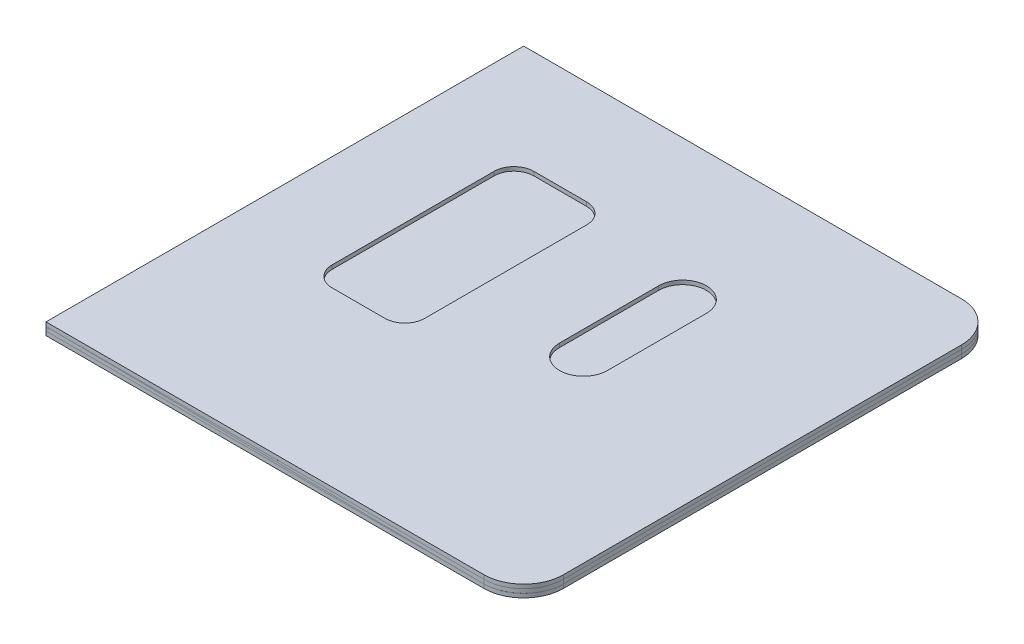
ISO-10303-21;
HEADER;
FILE_DESCRIPTION(('STEP AP214'),'2;1');
FILE_NAME('part.step','',(''),(''),'','','');
FILE_SCHEMA(('AUTOMOTIVE_DESIGN { 1 0 10303 214 1 1 1 1 }'));
ENDSEC;
DATA;
#1=APPLICATION_CONTEXT('core data for automotive mechanical design processes');
#2=APPLICATION_PROTOCOL_DEFINITION('international standard','automotive_design',2000,#1);
#3=PRODUCT_CONTEXT('',#1,'mechanical');
#4=PRODUCT('Part','Part','',(#3));
#5=PRODUCT_RELATED_PRODUCT_CATEGORY('part','',(#4));
#6=PRODUCT_DEFINITION_FORMATION('','',#4);
#7=PRODUCT_DEFINITION_CONTEXT('part definition',#1,'design');
#8=PRODUCT_DEFINITION('design','',#6,#7);
#9=PRODUCT_DEFINITION_SHAPE('','',#8);
#10=(LENGTH_UNIT() NAMED_UNIT(*) SI_UNIT(.MILLI.,.METRE.));
#11=(NAMED_UNIT(*) PLANE_ANGLE_UNIT() SI_UNIT($,.RADIAN.));
#12=(NAMED_UNIT(*) SI_UNIT($,.STERADIAN.) SOLID_ANGLE_UNIT());
#13=UNCERTAINTY_MEASURE_WITH_UNIT(LENGTH_MEASURE(1.E-05),#10,'distance_accuracy_value','');
#14=(GEOMETRIC_REPRESENTATION_CONTEXT(3) GLOBAL_UNCERTAINTY_ASSIGNED_CONTEXT((#13)) GLOBAL_UNIT_ASSIGNED_CONTEXT((#10,
#11,#12)) REPRESENTATION_CONTEXT('',''));
#15=CARTESIAN_POINT('',(0.,0.,0.));
#16=DIRECTION('',(0.,0.,1.));
#17=DIRECTION('',(1.,0.,0.));
#18=AXIS2_PLACEMENT_3D('',#15,#16,#17);
#19=CARTESIAN_POINT('',(57.025825,3.,-56.869625));
#20=DIRECTION('',(0.,1.,0.));
#21=DIRECTION('',(0.,0.,1.));
#22=AXIS2_PLACEMENT_3D('',#19,#20,#21);
#23=PLANE('',#22);
#24=CARTESIAN_POINT('',(15.0631424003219,3.,0.285799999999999));
#25=DIRECTION('',(0.,1.,0.));
#26=DIRECTION('',(0.,0.,1.));
#27=AXIS2_PLACEMENT_3D('',#24,#25,#26);
#28=CIRCLE('',#27,6.);
#29=CARTESIAN_POINT('',(9.06314240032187,3.,0.285799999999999));
#30=VERTEX_POINT('',#29);
#31=CARTESIAN_POINT('',(21.0631424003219,3.,0.285799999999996));
#32=VERTEX_POINT('',#31);
#33=EDGE_CURVE('E61',#30,#32,#28,.T.);
#34=ORIENTED_EDGE('',*,*,#33,.F.);
#35=DIRECTION('',(0.,0.,1.));
#36=VECTOR('',#35,1.);
#37=CARTESIAN_POINT('',(9.06314240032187,3.,0.285799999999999));
#38=LINE('',#37,#36);
#39=CARTESIAN_POINT('',(9.06314240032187,3.,-24.6101));
#40=VERTEX_POINT('',#39);
#41=EDGE_CURVE('E189',#40,#30,#38,.T.);
#42=ORIENTED_EDGE('',*,*,#41,.F.);
#43=CARTESIAN_POINT('',(15.0631424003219,3.,-24.6101));
#44=DIRECTION('',(0.,1.,0.));
#45=DIRECTION('',(0.,0.,1.));
#46=AXIS2_PLACEMENT_3D('',#43,#44,#45);
#47=CIRCLE('',#46,6.);
#48=CARTESIAN_POINT('',(21.0631424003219,3.,-24.6101));
#49=VERTEX_POINT('',#48);
#50=EDGE_CURVE('E192',#49,#40,#47,.T.);
#51=ORIENTED_EDGE('',*,*,#50,.F.);
#52=DIRECTION('',(0.,0.,-1.));
#53=VECTOR('',#52,1.);
#54=CARTESIAN_POINT('',(21.0631424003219,3.,0.285799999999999));
#55=LINE('',#54,#53);
#56=EDGE_CURVE('E198',#32,#49,#55,.T.);
#57=ORIENTED_EDGE('',*,*,#56,.F.);
#58=EDGE_LOOP('',(#34,#42,#51,#57));
#59=FACE_BOUND('',#58,.T.);
#60=DIRECTION('',(0.,0.,1.));
#61=VECTOR('',#60,1.);
#62=CARTESIAN_POINT('',(-60.0396,3.,60.1958));
#63=LINE('',#62,#61);
#64=CARTESIAN_POINT('',(-60.0396,3.,-59.8042));
#65=VERTEX_POINT('',#64);
#66=CARTESIAN_POINT('',(-60.0396,3.,60.1958));
#67=VERTEX_POINT('',#66);
#68=EDGE_CURVE('E281',#65,#67,#63,.T.);
#69=ORIENTED_EDGE('',*,*,#68,.T.);
#70=DIRECTION('',(1.,0.,0.));
#71=VECTOR('',#70,1.);
#72=CARTESIAN_POINT('',(49.9604,3.,60.1958));
#73=LINE('',#72,#71);
#74=CARTESIAN_POINT('',(49.9604,3.,60.1958));
#75=VERTEX_POINT('',#74);
#76=EDGE_CURVE('E316',#67,#75,#73,.T.);
#77=ORIENTED_EDGE('',*,*,#76,.T.);
#78=CARTESIAN_POINT('',(49.9604,3.,60.1958));
#79=CARTESIAN_POINT('',(55.4682,3.,60.1958));
#80=CARTESIAN_POINT('',(59.9604,3.,55.7036));
#81=CARTESIAN_POINT('',(59.9604,3.,50.1958));
#82=B_SPLINE_CURVE_WITH_KNOTS('',3,(#78,#79,#80,#81),.UNSPECIFIED.,.F.,.F.,(4,4),(0.5,
0.666666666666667),.UNSPECIFIED.);
#83=CARTESIAN_POINT('',(59.9604,3.,50.1958));
#84=VERTEX_POINT('',#83);
#85=EDGE_CURVE('E299',#75,#84,#82,.T.);
#86=ORIENTED_EDGE('',*,*,#85,.T.);
#87=DIRECTION('',(0.,0.,-1.));
#88=VECTOR('',#87,1.);
#89=CARTESIAN_POINT('',(59.9604,3.,-49.8042));
#90=LINE('',#89,#88);
#91=CARTESIAN_POINT('',(59.9604,3.,-49.8042));
#92=VERTEX_POINT('',#91);
#93=EDGE_CURVE('E250',#84,#92,#90,.T.);
#94=ORIENTED_EDGE('',*,*,#93,.T.);
#95=CARTESIAN_POINT('',(59.9604,3.,-49.8042));
#96=CARTESIAN_POINT('',(59.9604,3.,-55.312));
#97=CARTESIAN_POINT('',(55.4682,3.,-59.8042));
#98=CARTESIAN_POINT('',(49.9604,3.,-59.8042));
#99=B_SPLINE_CURVE_WITH_KNOTS('',3,(#95,#96,#97,#98),.UNSPECIFIED.,.F.,.F.,(4,4),
(0.166666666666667,0.333333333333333),.UNSPECIFIED.);
#100=CARTESIAN_POINT('',(49.9604,3.,-59.8042));
#101=VERTEX_POINT('',#100);
#102=EDGE_CURVE('E243',#92,#101,#99,.T.);
#103=ORIENTED_EDGE('',*,*,#102,.T.);
#104=DIRECTION('',(-1.,0.,0.));
#105=VECTOR('',#104,1.);
#106=CARTESIAN_POINT('',(-60.0396,3.,-59.8042));
#107=LINE('',#106,#105);
#108=EDGE_CURVE('E249',#101,#65,#107,.T.);
#109=ORIENTED_EDGE('',*,*,#108,.T.);
#110=EDGE_LOOP('',(#69,#77,#86,#94,#103,#109));
#111=FACE_BOUND('',#110,.T.);
#112=DIRECTION('',(0.,0.,1.));
#113=VECTOR('',#112,1.);
#114=CARTESIAN_POINT('',(-36.5083,3.,11.862));
#115=LINE('',#114,#113);
#116=CARTESIAN_POINT('',(-36.5083,3.,-28.8294));
#117=VERTEX_POINT('',#116);
#118=CARTESIAN_POINT('',(-36.5083,3.,11.862));
#119=VERTEX_POINT('',#118);
#120=EDGE_CURVE('E213',#117,#119,#115,.T.);
#121=ORIENTED_EDGE('',*,*,#120,.F.);
#122=CARTESIAN_POINT('',(-31.5083,3.,-33.8294));
#123=CARTESIAN_POINT('',(-34.2583,3.,-33.8294));
#124=CARTESIAN_POINT('',(-36.5083,3.,-31.5794));
#125=CARTESIAN_POINT('',(-36.5083,3.,-28.8294));
#126=B_SPLINE_CURVE_WITH_KNOTS('',3,(#122,#123,#124,#125),.UNSPECIFIED.,.F.,.F.,(4,4),(0.875,
1.),.UNSPECIFIED.);
#127=CARTESIAN_POINT('',(-31.5083,3.,-33.8294));
#128=VERTEX_POINT('',#127);
#129=EDGE_CURVE('E208',#128,#117,#126,.T.);
#130=ORIENTED_EDGE('',*,*,#129,.F.);
#131=DIRECTION('',(-1.,0.,0.));
#132=VECTOR('',#131,1.);
#133=CARTESIAN_POINT('',(-31.5083,3.,-33.8294));
#134=LINE('',#133,#132);
#135=CARTESIAN_POINT('',(-18.2259,3.,-33.8294));
#136=VERTEX_POINT('',#135);
#137=EDGE_CURVE('E352',#136,#128,#134,.T.);
#138=ORIENTED_EDGE('',*,*,#137,.F.);
#139=CARTESIAN_POINT('',(-13.2259,3.,-28.8294));
#140=CARTESIAN_POINT('',(-13.2259,3.,-31.578));
#141=CARTESIAN_POINT('',(-15.4759,3.,-33.8294));
#142=CARTESIAN_POINT('',(-18.2259,3.,-33.8294));
#143=B_SPLINE_CURVE_WITH_KNOTS('',3,(#139,#140,#141,#142),.UNSPECIFIED.,.F.,.F.,(4,4),(0.125,
0.25),.UNSPECIFIED.);
#144=CARTESIAN_POINT('',(-13.2259,3.,-28.8294));
#145=VERTEX_POINT('',#144);
#146=EDGE_CURVE('E396',#145,#136,#143,.T.);
#147=ORIENTED_EDGE('',*,*,#146,.F.);
#148=DIRECTION('',(0.,0.,-1.));
#149=VECTOR('',#148,1.);
#150=CARTESIAN_POINT('',(-13.2259,3.,-28.8294));
#151=LINE('',#150,#149);
#152=CARTESIAN_POINT('',(-13.2259,3.,11.862));
#153=VERTEX_POINT('',#152);
#154=EDGE_CURVE('E402',#153,#145,#151,.T.);
#155=ORIENTED_EDGE('',*,*,#154,.F.);
#156=CARTESIAN_POINT('',(-18.2259,3.,16.862));
#157=CARTESIAN_POINT('',(-15.4773,3.,16.862));
#158=CARTESIAN_POINT('',(-13.2259,3.,14.6106));
#159=CARTESIAN_POINT('',(-13.2259,3.,11.862));
#160=B_SPLINE_CURVE_WITH_KNOTS('',3,(#156,#157,#158,#159),.UNSPECIFIED.,.F.,.F.,(4,4),(0.375,
0.5),.UNSPECIFIED.);
#161=CARTESIAN_POINT('',(-18.2259,3.,16.862));
#162=VERTEX_POINT('',#161);
#163=EDGE_CURVE('E424',#162,#153,#160,.T.);
#164=ORIENTED_EDGE('',*,*,#163,.F.);
#165=DIRECTION('',(1.,0.,0.));
#166=VECTOR('',#165,1.);
#167=CARTESIAN_POINT('',(-18.2259,3.,16.862));
#168=LINE('',#167,#166);
#169=CARTESIAN_POINT('',(-31.5083,3.,16.862));
#170=VERTEX_POINT('',#169);
#171=EDGE_CURVE('E429',#170,#162,#168,.T.);
#172=ORIENTED_EDGE('',*,*,#171,.F.);
#173=CARTESIAN_POINT('',(-36.5083,3.,11.862));
#174=CARTESIAN_POINT('',(-36.5083,3.,14.612));
#175=CARTESIAN_POINT('',(-34.2569,3.,16.862));
#176=CARTESIAN_POINT('',(-31.5083,3.,16.862));
#177=B_SPLINE_CURVE_WITH_KNOTS('',3,(#173,#174,#175,#176),.UNSPECIFIED.,.F.,.F.,(4,4),(0.625,
0.75),.UNSPECIFIED.);
#178=EDGE_CURVE('E433',#119,#170,#177,.T.);
#179=ORIENTED_EDGE('',*,*,#178,.F.);
#180=EDGE_LOOP('',(#121,#130,#138,#147,#155,#164,#172,#179));
#181=FACE_BOUND('',#180,.T.);
#182=ADVANCED_FACE('F46',(#59,#111,#181),#23,.T.);
#183=CARTESIAN_POINT('',(57.025825,2.,-56.869625));
#184=DIRECTION('',(0.,1.,0.));
#185=DIRECTION('',(0.,0.,1.));
#186=AXIS2_PLACEMENT_3D('',#183,#184,#185);
#187=PLANE('',#186);
#188=DIRECTION('',(0.,0.,1.));
#189=VECTOR('',#188,1.);
#190=CARTESIAN_POINT('',(9.06314240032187,2.,0.285799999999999));
#191=LINE('',#190,#189);
#192=CARTESIAN_POINT('',(9.06314240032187,2.,-24.6101));
#193=VERTEX_POINT('',#192);
#194=CARTESIAN_POINT('',(9.06314240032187,2.,0.285799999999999));
#195=VERTEX_POINT('',#194);
#196=EDGE_CURVE('E179',#193,#195,#191,.T.);
#197=ORIENTED_EDGE('',*,*,#196,.T.);
#198=CARTESIAN_POINT('',(15.0631424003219,2.,0.285799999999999));
#199=DIRECTION('',(0.,1.,0.));
#200=DIRECTION('',(0.,0.,1.));
#201=AXIS2_PLACEMENT_3D('',#198,#199,#200);
#202=CIRCLE('',#201,6.);
#203=CARTESIAN_POINT('',(21.0631424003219,2.,0.285799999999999));
#204=VERTEX_POINT('',#203);
#205=EDGE_CURVE('E173',#195,#204,#202,.T.);
#206=ORIENTED_EDGE('',*,*,#205,.T.);
#207=DIRECTION('',(0.,0.,-1.));
#208=VECTOR('',#207,1.);
#209=CARTESIAN_POINT('',(21.0631424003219,2.,0.285799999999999));
#210=LINE('',#209,#208);
#211=CARTESIAN_POINT('',(21.0631424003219,2.,-24.6101));
#212=VERTEX_POINT('',#211);
#213=EDGE_CURVE('E182',#204,#212,#210,.T.);
#214=ORIENTED_EDGE('',*,*,#213,.T.);
#215=CARTESIAN_POINT('',(15.0631424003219,2.,-24.6101));
#216=DIRECTION('',(0.,1.,0.));
#217=DIRECTION('',(0.,0.,1.));
#218=AXIS2_PLACEMENT_3D('',#215,#216,#217);
#219=CIRCLE('',#218,6.);
#220=EDGE_CURVE('E69',#212,#193,#219,.T.);
#221=ORIENTED_EDGE('',*,*,#220,.T.);
#222=EDGE_LOOP('',(#197,#206,#214,#221));
#223=FACE_BOUND('',#222,.T.);
#224=DIRECTION('',(0.,0.,1.));
#225=VECTOR('',#224,1.);
#226=CARTESIAN_POINT('',(-60.0396,2.,60.1958));
#227=LINE('',#226,#225);
#228=CARTESIAN_POINT('',(-60.0396,2.,-59.8042));
#229=VERTEX_POINT('',#228);
#230=CARTESIAN_POINT('',(-60.0396,2.,60.1958));
#231=VERTEX_POINT('',#230);
#232=EDGE_CURVE('E257',#229,#231,#227,.T.);
#233=ORIENTED_EDGE('',*,*,#232,.F.);
#234=DIRECTION('',(-1.,0.,0.));
#235=VECTOR('',#234,1.);
#236=CARTESIAN_POINT('',(-60.0396,2.,-59.8042));
#237=LINE('',#236,#235);
#238=CARTESIAN_POINT('',(49.9604,2.,-59.8042));
#239=VERTEX_POINT('',#238);
#240=EDGE_CURVE('E276',#239,#229,#237,.T.);
#241=ORIENTED_EDGE('',*,*,#240,.F.);
#242=CARTESIAN_POINT('',(59.9604,2.,-49.8042));
#243=CARTESIAN_POINT('',(59.9604,2.,-55.312));
#244=CARTESIAN_POINT('',(55.4682,2.,-59.8042));
#245=CARTESIAN_POINT('',(49.9604,2.,-59.8042));
#246=B_SPLINE_CURVE_WITH_KNOTS('',3,(#242,#243,#244,#245),.UNSPECIFIED.,.F.,.F.,(4,4),
(0.166666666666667,0.333333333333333),.UNSPECIFIED.);
#247=CARTESIAN_POINT('',(59.9604,2.,-49.8042));
#248=VERTEX_POINT('',#247);
#249=EDGE_CURVE('E272',#248,#239,#246,.T.);
#250=ORIENTED_EDGE('',*,*,#249,.F.);
#251=DIRECTION('',(0.,0.,-1.));
#252=VECTOR('',#251,1.);
#253=CARTESIAN_POINT('',(59.9604,2.,-49.8042));
#254=LINE('',#253,#252);
#255=CARTESIAN_POINT('',(59.9604,2.,50.1958));
#256=VERTEX_POINT('',#255);
#257=EDGE_CURVE('E267',#256,#248,#254,.T.);
#258=ORIENTED_EDGE('',*,*,#257,.F.);
#259=CARTESIAN_POINT('',(49.9604,2.,60.1958));
#260=CARTESIAN_POINT('',(55.4682,2.,60.1958));
#261=CARTESIAN_POINT('',(59.9604,2.,55.7036));
#262=CARTESIAN_POINT('',(59.9604,2.,50.1958));
#263=B_SPLINE_CURVE_WITH_KNOTS('',3,(#259,#260,#261,#262),.UNSPECIFIED.,.F.,.F.,(4,4),(0.5,
0.666666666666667),.UNSPECIFIED.);
#264=CARTESIAN_POINT('',(49.9604,2.,60.1958));
#265=VERTEX_POINT('',#264);
#266=EDGE_CURVE('E263',#265,#256,#263,.T.);
#267=ORIENTED_EDGE('',*,*,#266,.F.);
#268=DIRECTION('',(1.,0.,0.));
#269=VECTOR('',#268,1.);
#270=CARTESIAN_POINT('',(49.9604,2.,60.1958));
#271=LINE('',#270,#269);
#272=EDGE_CURVE('E260',#231,#265,#271,.T.);
#273=ORIENTED_EDGE('',*,*,#272,.F.);
#274=EDGE_LOOP('',(#233,#241,#250,#258,#267,#273));
#275=FACE_BOUND('',#274,.T.);
#276=CARTESIAN_POINT('',(-31.5083,2.,-33.8294));
#277=CARTESIAN_POINT('',(-34.2583,2.,-33.8294));
#278=CARTESIAN_POINT('',(-36.5083,2.,-31.5794));
#279=CARTESIAN_POINT('',(-36.5083,2.,-28.8294));
#280=B_SPLINE_CURVE_WITH_KNOTS('',3,(#276,#277,#278,#279),.UNSPECIFIED.,.F.,.F.,(4,4),(0.875,
1.),.UNSPECIFIED.);
#281=CARTESIAN_POINT('',(-31.5083,2.,-33.8294));
#282=VERTEX_POINT('',#281);
#283=CARTESIAN_POINT('',(-36.5083,2.,-28.8294));
#284=VERTEX_POINT('',#283);
#285=EDGE_CURVE('E204',#282,#284,#280,.T.);
#286=ORIENTED_EDGE('',*,*,#285,.T.);
#287=DIRECTION('',(0.,0.,1.));
#288=VECTOR('',#287,1.);
#289=CARTESIAN_POINT('',(-36.5083,2.,11.862));
#290=LINE('',#289,#288);
#291=CARTESIAN_POINT('',(-36.5083,2.,11.862));
#292=VERTEX_POINT('',#291);
#293=EDGE_CURVE('E382',#284,#292,#290,.T.);
#294=ORIENTED_EDGE('',*,*,#293,.T.);
#295=CARTESIAN_POINT('',(-36.5083,2.,11.862));
#296=CARTESIAN_POINT('',(-36.5083,2.,14.612));
#297=CARTESIAN_POINT('',(-34.2569,2.,16.862));
#298=CARTESIAN_POINT('',(-31.5083,2.,16.862));
#299=B_SPLINE_CURVE_WITH_KNOTS('',3,(#295,#296,#297,#298),.UNSPECIFIED.,.F.,.F.,(4,4),(0.625,
0.75),.UNSPECIFIED.);
#300=CARTESIAN_POINT('',(-31.5083,2.,16.862));
#301=VERTEX_POINT('',#300);
#302=EDGE_CURVE('E377',#292,#301,#299,.T.);
#303=ORIENTED_EDGE('',*,*,#302,.T.);
#304=DIRECTION('',(1.,0.,0.));
#305=VECTOR('',#304,1.);
#306=CARTESIAN_POINT('',(-18.2259,2.,16.862));
#307=LINE('',#306,#305);
#308=CARTESIAN_POINT('',(-18.2259,2.,16.862));
#309=VERTEX_POINT('',#308);
#310=EDGE_CURVE('E371',#301,#309,#307,.T.);
#311=ORIENTED_EDGE('',*,*,#310,.T.);
#312=CARTESIAN_POINT('',(-18.2259,2.,16.862));
#313=CARTESIAN_POINT('',(-15.4773,2.,16.862));
#314=CARTESIAN_POINT('',(-13.2259,2.,14.6106));
#315=CARTESIAN_POINT('',(-13.2259,2.,11.862));
#316=B_SPLINE_CURVE_WITH_KNOTS('',3,(#312,#313,#314,#315),.UNSPECIFIED.,.F.,.F.,(4,4),(0.375,
0.5),.UNSPECIFIED.);
#317=CARTESIAN_POINT('',(-13.2259,2.,11.862));
#318=VERTEX_POINT('',#317);
#319=EDGE_CURVE('E366',#309,#318,#316,.T.);
#320=ORIENTED_EDGE('',*,*,#319,.T.);
#321=DIRECTION('',(0.,0.,-1.));
#322=VECTOR('',#321,1.);
#323=CARTESIAN_POINT('',(-13.2259,2.,-28.8294));
#324=LINE('',#323,#322);
#325=CARTESIAN_POINT('',(-13.2259,2.,-28.8294));
#326=VERTEX_POINT('',#325);
#327=EDGE_CURVE('E360',#318,#326,#324,.T.);
#328=ORIENTED_EDGE('',*,*,#327,.T.);
#329=CARTESIAN_POINT('',(-13.2259,2.,-28.8294));
#330=CARTESIAN_POINT('',(-13.2259,2.,-31.578));
#331=CARTESIAN_POINT('',(-15.4759,2.,-33.8294));
#332=CARTESIAN_POINT('',(-18.2259,2.,-33.8294));
#333=B_SPLINE_CURVE_WITH_KNOTS('',3,(#329,#330,#331,#332),.UNSPECIFIED.,.F.,.F.,(4,4),(0.125,
0.25),.UNSPECIFIED.);
#334=CARTESIAN_POINT('',(-18.2259,2.,-33.8294));
#335=VERTEX_POINT('',#334);
#336=EDGE_CURVE('E355',#326,#335,#333,.T.);
#337=ORIENTED_EDGE('',*,*,#336,.T.);
#338=DIRECTION('',(-1.,0.,0.));
#339=VECTOR('',#338,1.);
#340=CARTESIAN_POINT('',(-31.5083,2.,-33.8294));
#341=LINE('',#340,#339);
#342=EDGE_CURVE('E214',#335,#282,#341,.T.);
#343=ORIENTED_EDGE('',*,*,#342,.T.);
#344=EDGE_LOOP('',(#286,#294,#303,#311,#320,#328,#337,#343));
#345=FACE_BOUND('',#344,.T.);
#346=ADVANCED_FACE('F186',(#223,#275,#345),#187,.F.);
#347=CARTESIAN_POINT('',(-60.0396,3.,60.1958));
#348=DIRECTION('',(1.,0.,0.));
#349=DIRECTION('',(0.,0.,-1.));
#350=AXIS2_PLACEMENT_3D('',#347,#348,#349);
#351=PLANE('',#350);
#352=ORIENTED_EDGE('',*,*,#232,.T.);
#353=DIRECTION('',(0.,-1.,0.));
#354=VECTOR('',#353,1.);
#355=CARTESIAN_POINT('',(-60.0396,3.,60.1958));
#356=LINE('',#355,#354);
#357=EDGE_CURVE('E12',#67,#231,#356,.T.);
#358=ORIENTED_EDGE('',*,*,#357,.F.);
#359=ORIENTED_EDGE('',*,*,#68,.F.);
#360=DIRECTION('',(0.,-1.,0.));
#361=VECTOR('',#360,1.);
#362=CARTESIAN_POINT('',(-60.0396,3.,-59.8042));
#363=LINE('',#362,#361);
#364=EDGE_CURVE('E256',#65,#229,#363,.T.);
#365=ORIENTED_EDGE('',*,*,#364,.T.);
#366=EDGE_LOOP('',(#352,#358,#359,#365));
#367=FACE_BOUND('',#366,.T.);
#368=ADVANCED_FACE('F48',(#367),#351,.F.);
#369=CARTESIAN_POINT('',(49.9604,3.,60.1958));
#370=DIRECTION('',(0.,0.,-1.));
#371=DIRECTION('',(-1.,0.,0.));
#372=AXIS2_PLACEMENT_3D('',#369,#370,#371);
#373=PLANE('',#372);
#374=ORIENTED_EDGE('',*,*,#272,.T.);
#375=DIRECTION('',(0.,-1.,0.));
#376=VECTOR('',#375,1.);
#377=CARTESIAN_POINT('',(49.9604,3.,60.1958));
#378=LINE('',#377,#376);
#379=EDGE_CURVE('E54',#75,#265,#378,.T.);
#380=ORIENTED_EDGE('',*,*,#379,.F.);
#381=ORIENTED_EDGE('',*,*,#76,.F.);
#382=ORIENTED_EDGE('',*,*,#357,.T.);
#383=EDGE_LOOP('',(#374,#380,#381,#382));
#384=FACE_BOUND('',#383,.T.);
#385=ADVANCED_FACE('F326',(#384),#373,.F.);
#386=DIRECTION('',(0.,-1.,0.));
#387=VECTOR('',#386,1.);
#388=SURFACE_OF_LINEAR_EXTRUSION('',#82,#387);
#389=ORIENTED_EDGE('',*,*,#266,.T.);
#390=DIRECTION('',(0.,-1.,0.));
#391=VECTOR('',#390,1.);
#392=CARTESIAN_POINT('',(59.9604,3.,50.1958));
#393=LINE('',#392,#391);
#394=EDGE_CURVE('E290',#84,#256,#393,.T.);
#395=ORIENTED_EDGE('',*,*,#394,.F.);
#396=ORIENTED_EDGE('',*,*,#85,.F.);
#397=ORIENTED_EDGE('',*,*,#379,.T.);
#398=EDGE_LOOP('',(#389,#395,#396,#397));
#399=FACE_BOUND('',#398,.T.);
#400=ADVANCED_FACE('F297',(#399),#388,.F.);
#401=CARTESIAN_POINT('',(59.9604,3.,-49.8042));
#402=DIRECTION('',(-1.,0.,0.));
#403=DIRECTION('',(0.,0.,1.));
#404=AXIS2_PLACEMENT_3D('',#401,#402,#403);
#405=PLANE('',#404);
#406=ORIENTED_EDGE('',*,*,#257,.T.);
#407=DIRECTION('',(0.,-1.,0.));
#408=VECTOR('',#407,1.);
#409=CARTESIAN_POINT('',(59.9604,3.,-49.8042));
#410=LINE('',#409,#408);
#411=EDGE_CURVE('E287',#92,#248,#410,.T.);
#412=ORIENTED_EDGE('',*,*,#411,.F.);
#413=ORIENTED_EDGE('',*,*,#93,.F.);
#414=ORIENTED_EDGE('',*,*,#394,.T.);
#415=EDGE_LOOP('',(#406,#412,#413,#414));
#416=FACE_BOUND('',#415,.T.);
#417=ADVANCED_FACE('F240',(#416),#405,.F.);
#418=DIRECTION('',(0.,-1.,0.));
#419=VECTOR('',#418,1.);
#420=SURFACE_OF_LINEAR_EXTRUSION('',#99,#419);
#421=ORIENTED_EDGE('',*,*,#249,.T.);
#422=DIRECTION('',(0.,-1.,0.));
#423=VECTOR('',#422,1.);
#424=CARTESIAN_POINT('',(49.9604,3.,-59.8042));
#425=LINE('',#424,#423);
#426=EDGE_CURVE('E284',#101,#239,#425,.T.);
#427=ORIENTED_EDGE('',*,*,#426,.F.);
#428=ORIENTED_EDGE('',*,*,#102,.F.);
#429=ORIENTED_EDGE('',*,*,#411,.T.);
#430=EDGE_LOOP('',(#421,#427,#428,#429));
#431=FACE_BOUND('',#430,.T.);
#432=ADVANCED_FACE('F235',(#431),#420,.F.);
#433=CARTESIAN_POINT('',(-60.0396,3.,-59.8042));
#434=DIRECTION('',(0.,0.,1.));
#435=DIRECTION('',(1.,0.,0.));
#436=AXIS2_PLACEMENT_3D('',#433,#434,#435);
#437=PLANE('',#436);
#438=ORIENTED_EDGE('',*,*,#240,.T.);
#439=ORIENTED_EDGE('',*,*,#364,.F.);
#440=ORIENTED_EDGE('',*,*,#108,.F.);
#441=ORIENTED_EDGE('',*,*,#426,.T.);
#442=EDGE_LOOP('',(#438,#439,#440,#441));
#443=FACE_BOUND('',#442,.T.);
#444=ADVANCED_FACE('F225',(#443),#437,.F.);
#445=DIRECTION('',(0.,-1.,0.));
#446=VECTOR('',#445,1.);
#447=SURFACE_OF_LINEAR_EXTRUSION('',#126,#446);
#448=ORIENTED_EDGE('',*,*,#285,.F.);
#449=DIRECTION('',(0.,-1.,0.));
#450=VECTOR('',#449,1.);
#451=CARTESIAN_POINT('',(-31.5083,3.,-33.8294));
#452=LINE('',#451,#450);
#453=EDGE_CURVE('E349',#128,#282,#452,.T.);
#454=ORIENTED_EDGE('',*,*,#453,.F.);
#455=ORIENTED_EDGE('',*,*,#129,.T.);
#456=DIRECTION('',(0.,-1.,0.));
#457=VECTOR('',#456,1.);
#458=CARTESIAN_POINT('',(-36.5083,3.,-28.8294));
#459=LINE('',#458,#457);
#460=EDGE_CURVE('E261',#117,#284,#459,.T.);
#461=ORIENTED_EDGE('',*,*,#460,.T.);
#462=EDGE_LOOP('',(#448,#454,#455,#461));
#463=FACE_BOUND('',#462,.T.);
#464=ADVANCED_FACE('F220',(#463),#447,.T.);
#465=CARTESIAN_POINT('',(-36.5083,3.,11.862));
#466=DIRECTION('',(1.,0.,0.));
#467=DIRECTION('',(0.,0.,-1.));
#468=AXIS2_PLACEMENT_3D('',#465,#466,#467);
#469=PLANE('',#468);
#470=ORIENTED_EDGE('',*,*,#293,.F.);
#471=ORIENTED_EDGE('',*,*,#460,.F.);
#472=ORIENTED_EDGE('',*,*,#120,.T.);
#473=DIRECTION('',(0.,-1.,0.));
#474=VECTOR('',#473,1.);
#475=CARTESIAN_POINT('',(-36.5083,3.,11.862));
#476=LINE('',#475,#474);
#477=EDGE_CURVE('E337',#119,#292,#476,.T.);
#478=ORIENTED_EDGE('',*,*,#477,.T.);
#479=EDGE_LOOP('',(#470,#471,#472,#478));
#480=FACE_BOUND('',#479,.T.);
#481=ADVANCED_FACE('F224',(#480),#469,.T.);
#482=DIRECTION('',(0.,-1.,0.));
#483=VECTOR('',#482,1.);
#484=SURFACE_OF_LINEAR_EXTRUSION('',#177,#483);
#485=ORIENTED_EDGE('',*,*,#302,.F.);
#486=ORIENTED_EDGE('',*,*,#477,.F.);
#487=ORIENTED_EDGE('',*,*,#178,.T.);
#488=DIRECTION('',(0.,-1.,0.));
#489=VECTOR('',#488,1.);
#490=CARTESIAN_POINT('',(-31.5083,3.,16.862));
#491=LINE('',#490,#489);
#492=EDGE_CURVE('E339',#170,#301,#491,.T.);
#493=ORIENTED_EDGE('',*,*,#492,.T.);
#494=EDGE_LOOP('',(#485,#486,#487,#493));
#495=FACE_BOUND('',#494,.T.);
#496=ADVANCED_FACE('F440',(#495),#484,.T.);
#497=CARTESIAN_POINT('',(-18.2259,3.,16.862));
#498=DIRECTION('',(0.,0.,-1.));
#499=DIRECTION('',(-1.,0.,0.));
#500=AXIS2_PLACEMENT_3D('',#497,#498,#499);
#501=PLANE('',#500);
#502=ORIENTED_EDGE('',*,*,#310,.F.);
#503=ORIENTED_EDGE('',*,*,#492,.F.);
#504=ORIENTED_EDGE('',*,*,#171,.T.);
#505=DIRECTION('',(0.,-1.,0.));
#506=VECTOR('',#505,1.);
#507=CARTESIAN_POINT('',(-18.2259,3.,16.862));
#508=LINE('',#507,#506);
#509=EDGE_CURVE('E341',#162,#309,#508,.T.);
#510=ORIENTED_EDGE('',*,*,#509,.T.);
#511=EDGE_LOOP('',(#502,#503,#504,#510));
#512=FACE_BOUND('',#511,.T.);
#513=ADVANCED_FACE('F422',(#512),#501,.T.);
#514=DIRECTION('',(0.,-1.,0.));
#515=VECTOR('',#514,1.);
#516=SURFACE_OF_LINEAR_EXTRUSION('',#160,#515);
#517=ORIENTED_EDGE('',*,*,#319,.F.);
#518=ORIENTED_EDGE('',*,*,#509,.F.);
#519=ORIENTED_EDGE('',*,*,#163,.T.);
#520=DIRECTION('',(0.,-1.,0.));
#521=VECTOR('',#520,1.);
#522=CARTESIAN_POINT('',(-13.2259,3.,11.862));
#523=LINE('',#522,#521);
#524=EDGE_CURVE('E343',#153,#318,#523,.T.);
#525=ORIENTED_EDGE('',*,*,#524,.T.);
#526=EDGE_LOOP('',(#517,#518,#519,#525));
#527=FACE_BOUND('',#526,.T.);
#528=ADVANCED_FACE('F418',(#527),#516,.T.);
#529=CARTESIAN_POINT('',(-13.2259,3.,-28.8294));
#530=DIRECTION('',(-1.,0.,0.));
#531=DIRECTION('',(0.,0.,1.));
#532=AXIS2_PLACEMENT_3D('',#529,#530,#531);
#533=PLANE('',#532);
#534=ORIENTED_EDGE('',*,*,#327,.F.);
#535=ORIENTED_EDGE('',*,*,#524,.F.);
#536=ORIENTED_EDGE('',*,*,#154,.T.);
#537=DIRECTION('',(0.,-1.,0.));
#538=VECTOR('',#537,1.);
#539=CARTESIAN_POINT('',(-13.2259,3.,-28.8294));
#540=LINE('',#539,#538);
#541=EDGE_CURVE('E345',#145,#326,#540,.T.);
#542=ORIENTED_EDGE('',*,*,#541,.T.);
#543=EDGE_LOOP('',(#534,#535,#536,#542));
#544=FACE_BOUND('',#543,.T.);
#545=ADVANCED_FACE('F413',(#544),#533,.T.);
#546=DIRECTION('',(0.,-1.,0.));
#547=VECTOR('',#546,1.);
#548=SURFACE_OF_LINEAR_EXTRUSION('',#143,#547);
#549=ORIENTED_EDGE('',*,*,#336,.F.);
#550=ORIENTED_EDGE('',*,*,#541,.F.);
#551=ORIENTED_EDGE('',*,*,#146,.T.);
#552=DIRECTION('',(0.,-1.,0.));
#553=VECTOR('',#552,1.);
#554=CARTESIAN_POINT('',(-18.2259,3.,-33.8294));
#555=LINE('',#554,#553);
#556=EDGE_CURVE('E347',#136,#335,#555,.T.);
#557=ORIENTED_EDGE('',*,*,#556,.T.);
#558=EDGE_LOOP('',(#549,#550,#551,#557));
#559=FACE_BOUND('',#558,.T.);
#560=ADVANCED_FACE('F408',(#559),#548,.T.);
#561=CARTESIAN_POINT('',(-31.5083,3.,-33.8294));
#562=DIRECTION('',(0.,0.,1.));
#563=DIRECTION('',(1.,0.,0.));
#564=AXIS2_PLACEMENT_3D('',#561,#562,#563);
#565=PLANE('',#564);
#566=ORIENTED_EDGE('',*,*,#342,.F.);
#567=ORIENTED_EDGE('',*,*,#556,.F.);
#568=ORIENTED_EDGE('',*,*,#137,.T.);
#569=ORIENTED_EDGE('',*,*,#453,.T.);
#570=EDGE_LOOP('',(#566,#567,#568,#569));
#571=FACE_BOUND('',#570,.T.);
#572=ADVANCED_FACE('F412',(#571),#565,.T.);
#573=CARTESIAN_POINT('',(15.0631424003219,2.,0.285799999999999));
#574=DIRECTION('',(0.,1.,0.));
#575=DIRECTION('',(0.,0.,1.));
#576=AXIS2_PLACEMENT_3D('',#573,#574,#575);
#577=CYLINDRICAL_SURFACE('',#576,6.);
#578=ORIENTED_EDGE('',*,*,#33,.T.);
#579=DIRECTION('',(0.,1.,0.));
#580=VECTOR('',#579,1.);
#581=CARTESIAN_POINT('',(21.0631424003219,2.,0.285799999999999));
#582=LINE('',#581,#580);
#583=EDGE_CURVE('E169',#204,#32,#582,.T.);
#584=ORIENTED_EDGE('',*,*,#583,.F.);
#585=ORIENTED_EDGE('',*,*,#205,.F.);
#586=DIRECTION('',(0.,1.,0.));
#587=VECTOR('',#586,1.);
#588=CARTESIAN_POINT('',(9.06314240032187,2.,0.285799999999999));
#589=LINE('',#588,#587);
#590=EDGE_CURVE('E202',#195,#30,#589,.T.);
#591=ORIENTED_EDGE('',*,*,#590,.T.);
#592=EDGE_LOOP('',(#578,#584,#585,#591));
#593=FACE_BOUND('',#592,.T.);
#594=ADVANCED_FACE('F171',(#593),#577,.F.);
#595=CARTESIAN_POINT('',(9.06314240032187,2.,0.285799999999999));
#596=DIRECTION('',(-1.,0.,0.));
#597=DIRECTION('',(0.,0.,1.));
#598=AXIS2_PLACEMENT_3D('',#595,#596,#597);
#599=PLANE('',#598);
#600=ORIENTED_EDGE('',*,*,#41,.T.);
#601=ORIENTED_EDGE('',*,*,#590,.F.);
#602=ORIENTED_EDGE('',*,*,#196,.F.);
#603=DIRECTION('',(0.,1.,0.));
#604=VECTOR('',#603,1.);
#605=CARTESIAN_POINT('',(9.06314240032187,2.,-24.6101));
#606=LINE('',#605,#604);
#607=EDGE_CURVE('E205',#193,#40,#606,.T.);
#608=ORIENTED_EDGE('',*,*,#607,.T.);
#609=EDGE_LOOP('',(#600,#601,#602,#608));
#610=FACE_BOUND('',#609,.T.);
#611=ADVANCED_FACE('F475',(#610),#599,.F.);
#612=CARTESIAN_POINT('',(15.0631424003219,2.,-24.6101));
#613=DIRECTION('',(0.,1.,0.));
#614=DIRECTION('',(0.,0.,1.));
#615=AXIS2_PLACEMENT_3D('',#612,#613,#614);
#616=CYLINDRICAL_SURFACE('',#615,6.);
#617=ORIENTED_EDGE('',*,*,#50,.T.);
#618=ORIENTED_EDGE('',*,*,#607,.F.);
#619=ORIENTED_EDGE('',*,*,#220,.F.);
#620=DIRECTION('',(0.,1.,0.));
#621=VECTOR('',#620,1.);
#622=CARTESIAN_POINT('',(21.0631424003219,2.,-24.6101));
#623=LINE('',#622,#621);
#624=EDGE_CURVE('E178',#212,#49,#623,.T.);
#625=ORIENTED_EDGE('',*,*,#624,.T.);
#626=EDGE_LOOP('',(#617,#618,#619,#625));
#627=FACE_BOUND('',#626,.T.);
#628=ADVANCED_FACE('F479',(#627),#616,.F.);
#629=CARTESIAN_POINT('',(21.0631424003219,2.,0.285799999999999));
#630=DIRECTION('',(1.,0.,0.));
#631=DIRECTION('',(0.,0.,-1.));
#632=AXIS2_PLACEMENT_3D('',#629,#630,#631);
#633=PLANE('',#632);
#634=ORIENTED_EDGE('',*,*,#56,.T.);
#635=ORIENTED_EDGE('',*,*,#624,.F.);
#636=ORIENTED_EDGE('',*,*,#213,.F.);
#637=ORIENTED_EDGE('',*,*,#583,.T.);
#638=EDGE_LOOP('',(#634,#635,#636,#637));
#639=FACE_BOUND('',#638,.T.);
#640=ADVANCED_FACE('F183',(#639),#633,.F.);
#641=CLOSED_SHELL('',(#182,#346,#368,#385,#400,#417,#432,#444,#464,#481,#496,#513,#528,#545,
#560,#572,#594,#611,#628,#640));
#642=MANIFOLD_SOLID_BREP('B2',#641);
#643=CARTESIAN_POINT('',(38.8713,2.,-50.6463));
#644=DIRECTION('',(1.,0.,0.));
#645=DIRECTION('',(0.,0.,-1.));
#646=AXIS2_PLACEMENT_3D('',#643,#644,#645);
#647=PLANE('',#646);
#648=DIRECTION('',(0.,0.,1.));
#649=VECTOR('',#648,1.);
#650=CARTESIAN_POINT('',(38.8713,1.,-50.6463));
#651=LINE('',#650,#649);
#652=CARTESIAN_POINT('',(38.8713,1.,-59.8041));
#653=VERTEX_POINT('',#652);
#654=CARTESIAN_POINT('',(38.8713,1.,-50.6463));
#655=VERTEX_POINT('',#654);
#656=EDGE_CURVE('E956',#653,#655,#651,.T.);
#657=ORIENTED_EDGE('',*,*,#656,.T.);
#658=DIRECTION('',(0.,-1.,0.));
#659=VECTOR('',#658,1.);
#660=CARTESIAN_POINT('',(38.8713,2.,-50.6463));
#661=LINE('',#660,#659);
#662=CARTESIAN_POINT('',(38.8713,2.,-50.6463));
#663=VERTEX_POINT('',#662);
#664=EDGE_CURVE('E44',#663,#655,#661,.T.);
#665=ORIENTED_EDGE('',*,*,#664,.F.);
#666=DIRECTION('',(0.,0.,1.));
#667=VECTOR('',#666,1.);
#668=CARTESIAN_POINT('',(38.8713,2.,-50.6463));
#669=LINE('',#668,#667);
#670=CARTESIAN_POINT('',(38.8713,2.,-59.8041));
#671=VERTEX_POINT('',#670);
#672=EDGE_CURVE('E999',#671,#663,#669,.T.);
#673=ORIENTED_EDGE('',*,*,#672,.F.);
#674=DIRECTION('',(0.,-1.,0.));
#675=VECTOR('',#674,1.);
#676=CARTESIAN_POINT('',(38.8713,2.,-59.8041));
#677=LINE('',#676,#675);
#678=EDGE_CURVE('E778',#671,#653,#677,.T.);
#679=ORIENTED_EDGE('',*,*,#678,.T.);
#680=EDGE_LOOP('',(#657,#665,#673,#679));
#681=FACE_BOUND('',#680,.T.);
#682=ADVANCED_FACE('F626',(#681),#647,.F.);
#683=CARTESIAN_POINT('',(46.6141,2.,-50.6463));
#684=DIRECTION('',(0.,0.,-1.));
#685=DIRECTION('',(-1.,0.,0.));
#686=AXIS2_PLACEMENT_3D('',#683,#684,#685);
#687=PLANE('',#686);
#688=DIRECTION('',(1.,0.,0.));
#689=VECTOR('',#688,1.);
#690=CARTESIAN_POINT('',(46.6141,1.,-50.6463));
#691=LINE('',#690,#689);
#692=CARTESIAN_POINT('',(46.6141,1.,-50.6463));
#693=VERTEX_POINT('',#692);
#694=EDGE_CURVE('E950',#655,#693,#691,.T.);
#695=ORIENTED_EDGE('',*,*,#694,.T.);
#696=DIRECTION('',(0.,-1.,0.));
#697=VECTOR('',#696,1.);
#698=CARTESIAN_POINT('',(46.6141,2.,-50.6463));
#699=LINE('',#698,#697);
#700=CARTESIAN_POINT('',(46.6141,2.,-50.6463));
#701=VERTEX_POINT('',#700);
#702=EDGE_CURVE('E634',#701,#693,#699,.T.);
#703=ORIENTED_EDGE('',*,*,#702,.F.);
#704=DIRECTION('',(1.,0.,0.));
#705=VECTOR('',#704,1.);
#706=CARTESIAN_POINT('',(46.6141,2.,-50.6463));
#707=LINE('',#706,#705);
#708=EDGE_CURVE('E715',#663,#701,#707,.T.);
#709=ORIENTED_EDGE('',*,*,#708,.F.);
#710=ORIENTED_EDGE('',*,*,#664,.T.);
#711=EDGE_LOOP('',(#695,#703,#709,#710));
#712=FACE_BOUND('',#711,.T.);
#713=ADVANCED_FACE('F1028',(#712),#687,.F.);
#714=CARTESIAN_POINT('',(46.6141,2.,-1.9696));
#715=DIRECTION('',(1.,0.,0.));
#716=DIRECTION('',(0.,0.,-1.));
#717=AXIS2_PLACEMENT_3D('',#714,#715,#716);
#718=PLANE('',#717);
#719=DIRECTION('',(0.,0.,1.));
#720=VECTOR('',#719,1.);
#721=CARTESIAN_POINT('',(46.6141,1.,-1.9696));
#722=LINE('',#721,#720);
#723=CARTESIAN_POINT('',(46.6141,1.,-1.9696));
#724=VERTEX_POINT('',#723);
#725=EDGE_CURVE('E944',#693,#724,#722,.T.);
#726=ORIENTED_EDGE('',*,*,#725,.T.);
#727=DIRECTION('',(0.,-1.,0.));
#728=VECTOR('',#727,1.);
#729=CARTESIAN_POINT('',(46.6141,2.,-1.9696));
#730=LINE('',#729,#728);
#731=CARTESIAN_POINT('',(46.6141,2.,-1.9696));
#732=VERTEX_POINT('',#731);
#733=EDGE_CURVE('E936',#732,#724,#730,.T.);
#734=ORIENTED_EDGE('',*,*,#733,.F.);
#735=DIRECTION('',(0.,0.,1.));
#736=VECTOR('',#735,1.);
#737=CARTESIAN_POINT('',(46.6141,2.,-1.9696));
#738=LINE('',#737,#736);
#739=EDGE_CURVE('E945',#701,#732,#738,.T.);
#740=ORIENTED_EDGE('',*,*,#739,.F.);
#741=ORIENTED_EDGE('',*,*,#702,.T.);
#742=EDGE_LOOP('',(#726,#734,#740,#741));
#743=FACE_BOUND('',#742,.T.);
#744=ADVANCED_FACE('F942',(#743),#718,.F.);
#745=CARTESIAN_POINT('',(36.5597,2.,-1.9696));
#746=DIRECTION('',(0.,0.,1.));
#747=DIRECTION('',(1.,0.,0.));
#748=AXIS2_PLACEMENT_3D('',#745,#746,#747);
#749=PLANE('',#748);
#750=DIRECTION('',(-1.,0.,0.));
#751=VECTOR('',#750,1.);
#752=CARTESIAN_POINT('',(36.5597,1.,-1.9696));
#753=LINE('',#752,#751);
#754=CARTESIAN_POINT('',(36.5597,1.,-1.9696));
#755=VERTEX_POINT('',#754);
#756=EDGE_CURVE('E952',#724,#755,#753,.T.);
#757=ORIENTED_EDGE('',*,*,#756,.T.);
#758=DIRECTION('',(0.,-1.,0.));
#759=VECTOR('',#758,1.);
#760=CARTESIAN_POINT('',(36.5597,2.,-1.9696));
#761=LINE('',#760,#759);
#762=CARTESIAN_POINT('',(36.5597,2.,-1.9696));
#763=VERTEX_POINT('',#762);
#764=EDGE_CURVE('E933',#763,#755,#761,.T.);
#765=ORIENTED_EDGE('',*,*,#764,.F.);
#766=DIRECTION('',(-1.,0.,0.));
#767=VECTOR('',#766,1.);
#768=CARTESIAN_POINT('',(36.5597,2.,-1.9696));
#769=LINE('',#768,#767);
#770=EDGE_CURVE('E867',#732,#763,#769,.T.);
#771=ORIENTED_EDGE('',*,*,#770,.F.);
#772=ORIENTED_EDGE('',*,*,#733,.T.);
#773=EDGE_LOOP('',(#757,#765,#771,#772));
#774=FACE_BOUND('',#773,.T.);
#775=ADVANCED_FACE('F857',(#774),#749,.F.);
#776=CARTESIAN_POINT('',(36.5597,2.,-1.9696));
#777=CARTESIAN_POINT('',(36.5597,2.,13.1063));
#778=CARTESIAN_POINT('',(36.5598,2.,28.2091));
#779=CARTESIAN_POINT('',(36.5598,2.,43.285));
#780=B_SPLINE_CURVE_WITH_KNOTS('',3,(#776,#777,#778,#779),.UNSPECIFIED.,.F.,.F.,(4,4),
(0.722222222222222,0.777777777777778),.UNSPECIFIED.);
#781=DIRECTION('',(0.,-1.,0.));
#782=VECTOR('',#781,1.);
#783=SURFACE_OF_LINEAR_EXTRUSION('',#780,#782);
#784=CARTESIAN_POINT('',(36.5597,1.,-1.9696));
#785=CARTESIAN_POINT('',(36.5597,1.,13.1063));
#786=CARTESIAN_POINT('',(36.5598,1.,28.2091));
#787=CARTESIAN_POINT('',(36.5598,1.,43.285));
#788=B_SPLINE_CURVE_WITH_KNOTS('',3,(#784,#785,#786,#787),.UNSPECIFIED.,.F.,.F.,(4,4),
(0.722222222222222,0.777777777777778),.UNSPECIFIED.);
#789=CARTESIAN_POINT('',(36.5598,1.,43.285));
#790=VERTEX_POINT('',#789);
#791=EDGE_CURVE('E954',#755,#790,#788,.T.);
#792=ORIENTED_EDGE('',*,*,#791,.T.);
#793=DIRECTION('',(0.,-1.,0.));
#794=VECTOR('',#793,1.);
#795=CARTESIAN_POINT('',(36.5598,2.,43.285));
#796=LINE('',#795,#794);
#797=CARTESIAN_POINT('',(36.5598,2.,43.285));
#798=VERTEX_POINT('',#797);
#799=EDGE_CURVE('E930',#798,#790,#796,.T.);
#800=ORIENTED_EDGE('',*,*,#799,.F.);
#801=EDGE_CURVE('E860',#763,#798,#780,.T.);
#802=ORIENTED_EDGE('',*,*,#801,.F.);
#803=ORIENTED_EDGE('',*,*,#764,.T.);
#804=EDGE_LOOP('',(#792,#800,#802,#803));
#805=FACE_BOUND('',#804,.T.);
#806=ADVANCED_FACE('F852',(#805),#783,.F.);
#807=CARTESIAN_POINT('',(-39.0592,2.,43.285));
#808=DIRECTION('',(0.,0.,1.));
#809=DIRECTION('',(1.,0.,0.));
#810=AXIS2_PLACEMENT_3D('',#807,#808,#809);
#811=PLANE('',#810);
#812=DIRECTION('',(-1.,0.,0.));
#813=VECTOR('',#812,1.);
#814=CARTESIAN_POINT('',(-39.0592,1.,43.285));
#815=LINE('',#814,#813);
#816=CARTESIAN_POINT('',(-39.0592,1.,43.285));
#817=VERTEX_POINT('',#816);
#818=EDGE_CURVE('E962',#790,#817,#815,.T.);
#819=ORIENTED_EDGE('',*,*,#818,.T.);
#820=DIRECTION('',(0.,-1.,0.));
#821=VECTOR('',#820,1.);
#822=CARTESIAN_POINT('',(-39.0592,2.,43.285));
#823=LINE('',#822,#821);
#824=CARTESIAN_POINT('',(-39.0592,2.,43.285));
#825=VERTEX_POINT('',#824);
#826=EDGE_CURVE('E927',#825,#817,#823,.T.);
#827=ORIENTED_EDGE('',*,*,#826,.F.);
#828=DIRECTION('',(-1.,0.,0.));
#829=VECTOR('',#828,1.);
#830=CARTESIAN_POINT('',(-39.0592,2.,43.285));
#831=LINE('',#830,#829);
#832=EDGE_CURVE('E866',#798,#825,#831,.T.);
#833=ORIENTED_EDGE('',*,*,#832,.F.);
#834=ORIENTED_EDGE('',*,*,#799,.T.);
#835=EDGE_LOOP('',(#819,#827,#833,#834));
#836=FACE_BOUND('',#835,.T.);
#837=ADVANCED_FACE('F848',(#836),#811,.F.);
#838=CARTESIAN_POINT('',(-39.0329,2.,-1.9696));
#839=DIRECTION('',(-0.999999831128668,0.,-0.000581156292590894));
#840=DIRECTION('',(-0.000581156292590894,0.,0.999999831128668));
#841=AXIS2_PLACEMENT_3D('',#838,#839,#840);
#842=PLANE('',#841);
#843=DIRECTION('',(0.000581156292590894,0.,-0.999999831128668));
#844=VECTOR('',#843,1.);
#845=CARTESIAN_POINT('',(-39.0329,1.,-1.9696));
#846=LINE('',#845,#844);
#847=CARTESIAN_POINT('',(-39.0329,1.,-1.9696));
#848=VERTEX_POINT('',#847);
#849=EDGE_CURVE('E967',#817,#848,#846,.T.);
#850=ORIENTED_EDGE('',*,*,#849,.T.);
#851=DIRECTION('',(0.,-1.,0.));
#852=VECTOR('',#851,1.);
#853=CARTESIAN_POINT('',(-39.0329,2.,-1.9696));
#854=LINE('',#853,#852);
#855=CARTESIAN_POINT('',(-39.0329,2.,-1.9696));
#856=VERTEX_POINT('',#855);
#857=EDGE_CURVE('E924',#856,#848,#854,.T.);
#858=ORIENTED_EDGE('',*,*,#857,.F.);
#859=DIRECTION('',(0.000581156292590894,0.,-0.999999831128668));
#860=VECTOR('',#859,1.);
#861=CARTESIAN_POINT('',(-39.0329,2.,-1.9696));
#862=LINE('',#861,#860);
#863=EDGE_CURVE('E873',#825,#856,#862,.T.);
#864=ORIENTED_EDGE('',*,*,#863,.F.);
#865=ORIENTED_EDGE('',*,*,#826,.T.);
#866=EDGE_LOOP('',(#850,#858,#864,#865));
#867=FACE_BOUND('',#866,.T.);
#868=ADVANCED_FACE('F844',(#867),#842,.F.);
#869=CARTESIAN_POINT('',(-49.0125,2.,-1.9696));
#870=DIRECTION('',(0.,0.,1.));
#871=DIRECTION('',(1.,0.,0.));
#872=AXIS2_PLACEMENT_3D('',#869,#870,#871);
#873=PLANE('',#872);
#874=DIRECTION('',(-1.,0.,0.));
#875=VECTOR('',#874,1.);
#876=CARTESIAN_POINT('',(-49.0125,1.,-1.9696));
#877=LINE('',#876,#875);
#878=CARTESIAN_POINT('',(-49.0125,1.,-1.9696));
#879=VERTEX_POINT('',#878);
#880=EDGE_CURVE('E969',#848,#879,#877,.T.);
#881=ORIENTED_EDGE('',*,*,#880,.T.);
#882=DIRECTION('',(0.,-1.,0.));
#883=VECTOR('',#882,1.);
#884=CARTESIAN_POINT('',(-49.0125,2.,-1.9696));
#885=LINE('',#884,#883);
#886=CARTESIAN_POINT('',(-49.0125,2.,-1.9696));
#887=VERTEX_POINT('',#886);
#888=EDGE_CURVE('E921',#887,#879,#885,.T.);
#889=ORIENTED_EDGE('',*,*,#888,.F.);
#890=DIRECTION('',(-1.,0.,0.));
#891=VECTOR('',#890,1.);
#892=CARTESIAN_POINT('',(-49.0125,2.,-1.9696));
#893=LINE('',#892,#891);
#894=EDGE_CURVE('E875',#856,#887,#893,.T.);
#895=ORIENTED_EDGE('',*,*,#894,.F.);
#896=ORIENTED_EDGE('',*,*,#857,.T.);
#897=EDGE_LOOP('',(#881,#889,#895,#896));
#898=FACE_BOUND('',#897,.T.);
#899=ADVANCED_FACE('F840',(#898),#873,.F.);
#900=CARTESIAN_POINT('',(-49.0124,2.,-50.6465));
#901=DIRECTION('',(-0.99999999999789,0.,-2.0543625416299E-06));
#902=DIRECTION('',(-2.0543625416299E-06,0.,0.99999999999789));
#903=AXIS2_PLACEMENT_3D('',#900,#901,#902);
#904=PLANE('',#903);
#905=DIRECTION('',(2.0543625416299E-06,0.,-0.99999999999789));
#906=VECTOR('',#905,1.);
#907=CARTESIAN_POINT('',(-49.0124,1.,-50.6465));
#908=LINE('',#907,#906);
#909=CARTESIAN_POINT('',(-49.0124,1.,-50.6465));
#910=VERTEX_POINT('',#909);
#911=EDGE_CURVE('E971',#879,#910,#908,.T.);
#912=ORIENTED_EDGE('',*,*,#911,.T.);
#913=DIRECTION('',(0.,-1.,0.));
#914=VECTOR('',#913,1.);
#915=CARTESIAN_POINT('',(-49.0124,2.,-50.6465));
#916=LINE('',#915,#914);
#917=CARTESIAN_POINT('',(-49.0124,2.,-50.6465));
#918=VERTEX_POINT('',#917);
#919=EDGE_CURVE('E918',#918,#910,#916,.T.);
#920=ORIENTED_EDGE('',*,*,#919,.F.);
#921=DIRECTION('',(2.0543625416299E-06,0.,-0.99999999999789));
#922=VECTOR('',#921,1.);
#923=CARTESIAN_POINT('',(-49.0124,2.,-50.6465));
#924=LINE('',#923,#922);
#925=EDGE_CURVE('E877',#887,#918,#924,.T.);
#926=ORIENTED_EDGE('',*,*,#925,.F.);
#927=ORIENTED_EDGE('',*,*,#888,.T.);
#928=EDGE_LOOP('',(#912,#920,#926,#927));
#929=FACE_BOUND('',#928,.T.);
#930=ADVANCED_FACE('F836',(#929),#904,.F.);
#931=CARTESIAN_POINT('',(-38.958,2.,-50.6465));
#932=DIRECTION('',(0.,0.,-1.));
#933=DIRECTION('',(-1.,0.,0.));
#934=AXIS2_PLACEMENT_3D('',#931,#932,#933);
#935=PLANE('',#934);
#936=DIRECTION('',(1.,0.,0.));
#937=VECTOR('',#936,1.);
#938=CARTESIAN_POINT('',(-38.958,1.,-50.6465));
#939=LINE('',#938,#937);
#940=CARTESIAN_POINT('',(-38.958,1.,-50.6465));
#941=VERTEX_POINT('',#940);
#942=EDGE_CURVE('E973',#910,#941,#939,.T.);
#943=ORIENTED_EDGE('',*,*,#942,.T.);
#944=DIRECTION('',(0.,-1.,0.));
#945=VECTOR('',#944,1.);
#946=CARTESIAN_POINT('',(-38.958,2.,-50.6465));
#947=LINE('',#946,#945);
#948=CARTESIAN_POINT('',(-38.958,2.,-50.6465));
#949=VERTEX_POINT('',#948);
#950=EDGE_CURVE('E891',#949,#941,#947,.T.);
#951=ORIENTED_EDGE('',*,*,#950,.F.);
#952=DIRECTION('',(1.,0.,0.));
#953=VECTOR('',#952,1.);
#954=CARTESIAN_POINT('',(-38.958,2.,-50.6465));
#955=LINE('',#954,#953);
#956=EDGE_CURVE('E878',#918,#949,#955,.T.);
#957=ORIENTED_EDGE('',*,*,#956,.F.);
#958=ORIENTED_EDGE('',*,*,#919,.T.);
#959=EDGE_LOOP('',(#943,#951,#957,#958));
#960=FACE_BOUND('',#959,.T.);
#961=ADVANCED_FACE('F832',(#960),#935,.F.);
#962=CARTESIAN_POINT('',(-38.958,2.,-59.8043));
#963=DIRECTION('',(-1.,0.,0.));
#964=DIRECTION('',(0.,0.,1.));
#965=AXIS2_PLACEMENT_3D('',#962,#963,#964);
#966=PLANE('',#965);
#967=DIRECTION('',(0.,0.,-1.));
#968=VECTOR('',#967,1.);
#969=CARTESIAN_POINT('',(-38.958,1.,-59.8043));
#970=LINE('',#969,#968);
#971=CARTESIAN_POINT('',(-38.958,1.,-59.8043));
#972=VERTEX_POINT('',#971);
#973=EDGE_CURVE('E889',#941,#972,#970,.T.);
#974=ORIENTED_EDGE('',*,*,#973,.T.);
#975=DIRECTION('',(0.,-1.,0.));
#976=VECTOR('',#975,1.);
#977=CARTESIAN_POINT('',(-38.958,2.,-59.8043));
#978=LINE('',#977,#976);
#979=CARTESIAN_POINT('',(-38.958,2.,-59.8043));
#980=VERTEX_POINT('',#979);
#981=EDGE_CURVE('E887',#980,#972,#978,.T.);
#982=ORIENTED_EDGE('',*,*,#981,.F.);
#983=DIRECTION('',(0.,0.,-1.));
#984=VECTOR('',#983,1.);
#985=CARTESIAN_POINT('',(-38.958,2.,-59.8043));
#986=LINE('',#985,#984);
#987=EDGE_CURVE('E818',#949,#980,#986,.T.);
#988=ORIENTED_EDGE('',*,*,#987,.F.);
#989=ORIENTED_EDGE('',*,*,#950,.T.);
#990=EDGE_LOOP('',(#974,#982,#988,#989));
#991=FACE_BOUND('',#990,.T.);
#992=ADVANCED_FACE('F828',(#991),#966,.F.);
#993=CARTESIAN_POINT('',(-38.958,2.,-59.8043));
#994=CARTESIAN_POINT('',(-45.9853,2.,-59.8043));
#995=CARTESIAN_POINT('',(-53.0124,2.,-59.8042));
#996=CARTESIAN_POINT('',(-60.0396,2.,-59.8041));
#997=B_SPLINE_CURVE_WITH_KNOTS('',3,(#993,#994,#995,#996),.UNSPECIFIED.,.F.,.F.,(4,4),
(0.333333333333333,0.388888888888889),.UNSPECIFIED.);
#998=DIRECTION('',(0.,-1.,0.));
#999=VECTOR('',#998,1.);
#1000=SURFACE_OF_LINEAR_EXTRUSION('',#997,#999);
#1001=CARTESIAN_POINT('',(-38.958,1.,-59.8043));
#1002=CARTESIAN_POINT('',(-45.9853,1.,-59.8043));
#1003=CARTESIAN_POINT('',(-53.0124,1.,-59.8042));
#1004=CARTESIAN_POINT('',(-60.0396,1.,-59.8041));
#1005=B_SPLINE_CURVE_WITH_KNOTS('',3,(#1001,#1002,#1003,#1004),.UNSPECIFIED.,.F.,.F.,(4,4),
(0.333333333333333,0.388888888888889),.UNSPECIFIED.);
#1006=CARTESIAN_POINT('',(-60.0396,1.,-59.8041));
#1007=VERTEX_POINT('',#1006);
#1008=EDGE_CURVE('E896',#972,#1007,#1005,.T.);
#1009=ORIENTED_EDGE('',*,*,#1008,.T.);
#1010=DIRECTION('',(0.,-1.,0.));
#1011=VECTOR('',#1010,1.);
#1012=CARTESIAN_POINT('',(-60.0396,2.,-59.8041));
#1013=LINE('',#1012,#1011);
#1014=CARTESIAN_POINT('',(-60.0396,2.,-59.8041));
#1015=VERTEX_POINT('',#1014);
#1016=EDGE_CURVE('E892',#1015,#1007,#1013,.T.);
#1017=ORIENTED_EDGE('',*,*,#1016,.F.);
#1018=EDGE_CURVE('E813',#980,#1015,#997,.T.);
#1019=ORIENTED_EDGE('',*,*,#1018,.F.);
#1020=ORIENTED_EDGE('',*,*,#981,.T.);
#1021=EDGE_LOOP('',(#1009,#1017,#1019,#1020));
#1022=FACE_BOUND('',#1021,.T.);
#1023=ADVANCED_FACE('F824',(#1022),#1000,.F.);
#1024=CARTESIAN_POINT('',(-60.0396,2.,60.1959));
#1025=DIRECTION('',(1.,0.,0.));
#1026=DIRECTION('',(0.,0.,-1.));
#1027=AXIS2_PLACEMENT_3D('',#1024,#1025,#1026);
#1028=PLANE('',#1027);
#1029=DIRECTION('',(0.,0.,1.));
#1030=VECTOR('',#1029,1.);
#1031=CARTESIAN_POINT('',(-60.0396,1.,60.1959));
#1032=LINE('',#1031,#1030);
#1033=CARTESIAN_POINT('',(-60.0396,1.,60.1959));
#1034=VERTEX_POINT('',#1033);
#1035=EDGE_CURVE('E979',#1007,#1034,#1032,.T.);
#1036=ORIENTED_EDGE('',*,*,#1035,.T.);
#1037=DIRECTION('',(0.,-1.,0.));
#1038=VECTOR('',#1037,1.);
#1039=CARTESIAN_POINT('',(-60.0396,2.,60.1959));
#1040=LINE('',#1039,#1038);
#1041=CARTESIAN_POINT('',(-60.0396,2.,60.1959));
#1042=VERTEX_POINT('',#1041);
#1043=EDGE_CURVE('E899',#1042,#1034,#1040,.T.);
#1044=ORIENTED_EDGE('',*,*,#1043,.F.);
#1045=DIRECTION('',(0.,0.,1.));
#1046=VECTOR('',#1045,1.);
#1047=CARTESIAN_POINT('',(-60.0396,2.,60.1959));
#1048=LINE('',#1047,#1046);
#1049=EDGE_CURVE('E811',#1015,#1042,#1048,.T.);
#1050=ORIENTED_EDGE('',*,*,#1049,.F.);
#1051=ORIENTED_EDGE('',*,*,#1016,.T.);
#1052=EDGE_LOOP('',(#1036,#1044,#1050,#1051));
#1053=FACE_BOUND('',#1052,.T.);
#1054=ADVANCED_FACE('F827',(#1053),#1028,.F.);
#1055=CARTESIAN_POINT('',(49.9606,2.,60.1959));
#1056=DIRECTION('',(0.,0.,-1.));
#1057=DIRECTION('',(-1.,0.,0.));
#1058=AXIS2_PLACEMENT_3D('',#1055,#1056,#1057);
#1059=PLANE('',#1058);
#1060=DIRECTION('',(1.,0.,0.));
#1061=VECTOR('',#1060,1.);
#1062=CARTESIAN_POINT('',(49.9606,1.,60.1959));
#1063=LINE('',#1062,#1061);
#1064=CARTESIAN_POINT('',(49.9606,1.,60.1959));
#1065=VERTEX_POINT('',#1064);
#1066=EDGE_CURVE('E909',#1034,#1065,#1063,.T.);
#1067=ORIENTED_EDGE('',*,*,#1066,.T.);
#1068=DIRECTION('',(0.,-1.,0.));
#1069=VECTOR('',#1068,1.);
#1070=CARTESIAN_POINT('',(49.9606,2.,60.1959));
#1071=LINE('',#1070,#1069);
#1072=CARTESIAN_POINT('',(49.9606,2.,60.1959));
#1073=VERTEX_POINT('',#1072);
#1074=EDGE_CURVE('E907',#1073,#1065,#1071,.T.);
#1075=ORIENTED_EDGE('',*,*,#1074,.F.);
#1076=DIRECTION('',(1.,0.,0.));
#1077=VECTOR('',#1076,1.);
#1078=CARTESIAN_POINT('',(49.9606,2.,60.1959));
#1079=LINE('',#1078,#1077);
#1080=EDGE_CURVE('E806',#1042,#1073,#1079,.T.);
#1081=ORIENTED_EDGE('',*,*,#1080,.F.);
#1082=ORIENTED_EDGE('',*,*,#1043,.T.);
#1083=EDGE_LOOP('',(#1067,#1075,#1081,#1082));
#1084=FACE_BOUND('',#1083,.T.);
#1085=ADVANCED_FACE('F799',(#1084),#1059,.F.);
#1086=CARTESIAN_POINT('',(49.9606,2.,60.1959));
#1087=CARTESIAN_POINT('',(55.4602,2.,60.1959));
#1088=CARTESIAN_POINT('',(59.9604,2.,55.6957));
#1089=CARTESIAN_POINT('',(59.9604,2.,50.1961));
#1090=B_SPLINE_CURVE_WITH_KNOTS('',3,(#1086,#1087,#1088,#1089),.UNSPECIFIED.,.F.,.F.,(4,4),
(0.166666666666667,0.222222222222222),.UNSPECIFIED.);
#1091=DIRECTION('',(0.,-1.,0.));
#1092=VECTOR('',#1091,1.);
#1093=SURFACE_OF_LINEAR_EXTRUSION('',#1090,#1092);
#1094=CARTESIAN_POINT('',(49.9606,1.,60.1959));
#1095=CARTESIAN_POINT('',(55.4602,1.,60.1959));
#1096=CARTESIAN_POINT('',(59.9604,1.,55.6957));
#1097=CARTESIAN_POINT('',(59.9604,1.,50.1961));
#1098=B_SPLINE_CURVE_WITH_KNOTS('',3,(#1094,#1095,#1096,#1097),.UNSPECIFIED.,.F.,.F.,(4,4),
(0.166666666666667,0.222222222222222),.UNSPECIFIED.);
#1099=CARTESIAN_POINT('',(59.9604,1.,50.1961));
#1100=VERTEX_POINT('',#1099);
#1101=EDGE_CURVE('E912',#1065,#1100,#1098,.T.);
#1102=ORIENTED_EDGE('',*,*,#1101,.T.);
#1103=DIRECTION('',(0.,-1.,0.));
#1104=VECTOR('',#1103,1.);
#1105=CARTESIAN_POINT('',(59.9604,2.,50.1961));
#1106=LINE('',#1105,#1104);
#1107=CARTESIAN_POINT('',(59.9604,2.,50.1961));
#1108=VERTEX_POINT('',#1107);
#1109=EDGE_CURVE('E773',#1108,#1100,#1106,.T.);
#1110=ORIENTED_EDGE('',*,*,#1109,.F.);
#1111=EDGE_CURVE('E764',#1073,#1108,#1090,.T.);
#1112=ORIENTED_EDGE('',*,*,#1111,.F.);
#1113=ORIENTED_EDGE('',*,*,#1074,.T.);
#1114=EDGE_LOOP('',(#1102,#1110,#1112,#1113));
#1115=FACE_BOUND('',#1114,.T.);
#1116=ADVANCED_FACE('F796',(#1115),#1093,.F.);
#1117=CARTESIAN_POINT('',(59.9604,2.,-49.8043));
#1118=DIRECTION('',(-1.,0.,0.));
#1119=DIRECTION('',(0.,0.,1.));
#1120=AXIS2_PLACEMENT_3D('',#1117,#1118,#1119);
#1121=PLANE('',#1120);
#1122=DIRECTION('',(0.,0.,-1.));
#1123=VECTOR('',#1122,1.);
#1124=CARTESIAN_POINT('',(59.9604,1.,-49.8043));
#1125=LINE('',#1124,#1123);
#1126=CARTESIAN_POINT('',(59.9604,1.,-49.8043));
#1127=VERTEX_POINT('',#1126);
#1128=EDGE_CURVE('E772',#1100,#1127,#1125,.T.);
#1129=ORIENTED_EDGE('',*,*,#1128,.T.);
#1130=DIRECTION('',(0.,-1.,0.));
#1131=VECTOR('',#1130,1.);
#1132=CARTESIAN_POINT('',(59.9604,2.,-49.8043));
#1133=LINE('',#1132,#1131);
#1134=CARTESIAN_POINT('',(59.9604,2.,-49.8043));
#1135=VERTEX_POINT('',#1134);
#1136=EDGE_CURVE('E769',#1135,#1127,#1133,.T.);
#1137=ORIENTED_EDGE('',*,*,#1136,.F.);
#1138=DIRECTION('',(0.,0.,-1.));
#1139=VECTOR('',#1138,1.);
#1140=CARTESIAN_POINT('',(59.9604,2.,-49.8043));
#1141=LINE('',#1140,#1139);
#1142=EDGE_CURVE('E758',#1108,#1135,#1141,.T.);
#1143=ORIENTED_EDGE('',*,*,#1142,.F.);
#1144=ORIENTED_EDGE('',*,*,#1109,.T.);
#1145=EDGE_LOOP('',(#1129,#1137,#1143,#1144));
#1146=FACE_BOUND('',#1145,.T.);
#1147=ADVANCED_FACE('F770',(#1146),#1121,.F.);
#1148=CARTESIAN_POINT('',(59.9604,2.,-49.8043));
#1149=CARTESIAN_POINT('',(59.9604,2.,-55.3037));
#1150=CARTESIAN_POINT('',(55.4602,2.,-59.8041));
#1151=CARTESIAN_POINT('',(49.9606,2.,-59.8041));
#1152=B_SPLINE_CURVE_WITH_KNOTS('',3,(#1148,#1149,#1150,#1151),.UNSPECIFIED.,.F.,.F.,(4,4),
(0.0555555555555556,0.111111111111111),.UNSPECIFIED.);
#1153=DIRECTION('',(0.,-1.,0.));
#1154=VECTOR('',#1153,1.);
#1155=SURFACE_OF_LINEAR_EXTRUSION('',#1152,#1154);
#1156=CARTESIAN_POINT('',(59.9604,1.,-49.8043));
#1157=CARTESIAN_POINT('',(59.9604,1.,-55.3037));
#1158=CARTESIAN_POINT('',(55.4602,1.,-59.8041));
#1159=CARTESIAN_POINT('',(49.9606,1.,-59.8041));
#1160=B_SPLINE_CURVE_WITH_KNOTS('',3,(#1156,#1157,#1158,#1159),.UNSPECIFIED.,.F.,.F.,(4,4),
(0.0555555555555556,0.111111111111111),.UNSPECIFIED.);
#1161=CARTESIAN_POINT('',(49.9606,1.,-59.8041));
#1162=VERTEX_POINT('',#1161);
#1163=EDGE_CURVE('E701',#1127,#1162,#1160,.T.);
#1164=ORIENTED_EDGE('',*,*,#1163,.T.);
#1165=DIRECTION('',(0.,-1.,0.));
#1166=VECTOR('',#1165,1.);
#1167=CARTESIAN_POINT('',(49.9606,2.,-59.8041));
#1168=LINE('',#1167,#1166);
#1169=CARTESIAN_POINT('',(49.9606,2.,-59.8041));
#1170=VERTEX_POINT('',#1169);
#1171=EDGE_CURVE('E774',#1170,#1162,#1168,.T.);
#1172=ORIENTED_EDGE('',*,*,#1171,.F.);
#1173=EDGE_CURVE('E762',#1135,#1170,#1152,.T.);
#1174=ORIENTED_EDGE('',*,*,#1173,.F.);
#1175=ORIENTED_EDGE('',*,*,#1136,.T.);
#1176=EDGE_LOOP('',(#1164,#1172,#1174,#1175));
#1177=FACE_BOUND('',#1176,.T.);
#1178=ADVANCED_FACE('F776',(#1177),#1155,.F.);
#1179=CARTESIAN_POINT('',(38.8713,2.,-59.8041));
#1180=DIRECTION('',(0.,0.,1.));
#1181=DIRECTION('',(1.,0.,0.));
#1182=AXIS2_PLACEMENT_3D('',#1179,#1180,#1181);
#1183=PLANE('',#1182);
#1184=DIRECTION('',(-1.,0.,0.));
#1185=VECTOR('',#1184,1.);
#1186=CARTESIAN_POINT('',(38.8713,1.,-59.8041));
#1187=LINE('',#1186,#1185);
#1188=EDGE_CURVE('E707',#1162,#653,#1187,.T.);
#1189=ORIENTED_EDGE('',*,*,#1188,.T.);
#1190=ORIENTED_EDGE('',*,*,#678,.F.);
#1191=DIRECTION('',(-1.,0.,0.));
#1192=VECTOR('',#1191,1.);
#1193=CARTESIAN_POINT('',(38.8713,2.,-59.8041));
#1194=LINE('',#1193,#1192);
#1195=EDGE_CURVE('E642',#1170,#671,#1194,.T.);
#1196=ORIENTED_EDGE('',*,*,#1195,.F.);
#1197=ORIENTED_EDGE('',*,*,#1171,.T.);
#1198=EDGE_LOOP('',(#1189,#1190,#1196,#1197));
#1199=FACE_BOUND('',#1198,.T.);
#1200=ADVANCED_FACE('F792',(#1199),#1183,.F.);
#1201=CARTESIAN_POINT('',(57.02285,2.,-56.866475));
#1202=DIRECTION('',(0.,1.,0.));
#1203=DIRECTION('',(0.,0.,1.));
#1204=AXIS2_PLACEMENT_3D('',#1201,#1202,#1203);
#1205=PLANE('',#1204);
#1206=ORIENTED_EDGE('',*,*,#672,.T.);
#1207=ORIENTED_EDGE('',*,*,#708,.T.);
#1208=ORIENTED_EDGE('',*,*,#739,.T.);
#1209=ORIENTED_EDGE('',*,*,#770,.T.);
#1210=ORIENTED_EDGE('',*,*,#801,.T.);
#1211=ORIENTED_EDGE('',*,*,#832,.T.);
#1212=ORIENTED_EDGE('',*,*,#863,.T.);
#1213=ORIENTED_EDGE('',*,*,#894,.T.);
#1214=ORIENTED_EDGE('',*,*,#925,.T.);
#1215=ORIENTED_EDGE('',*,*,#956,.T.);
#1216=ORIENTED_EDGE('',*,*,#987,.T.);
#1217=ORIENTED_EDGE('',*,*,#1018,.T.);
#1218=ORIENTED_EDGE('',*,*,#1049,.T.);
#1219=ORIENTED_EDGE('',*,*,#1080,.T.);
#1220=ORIENTED_EDGE('',*,*,#1111,.T.);
#1221=ORIENTED_EDGE('',*,*,#1142,.T.);
#1222=ORIENTED_EDGE('',*,*,#1173,.T.);
#1223=ORIENTED_EDGE('',*,*,#1195,.T.);
#1224=EDGE_LOOP('',(#1206,#1207,#1208,#1209,#1210,#1211,#1212,#1213,#1214,#1215,#1216,#1217,
#1218,#1219,#1220,#1221,#1222,#1223));
#1225=FACE_BOUND('',#1224,.T.);
#1226=ADVANCED_FACE('F760',(#1225),#1205,.T.);
#1227=CARTESIAN_POINT('',(57.02285,1.,-56.866475));
#1228=DIRECTION('',(0.,1.,0.));
#1229=DIRECTION('',(0.,0.,1.));
#1230=AXIS2_PLACEMENT_3D('',#1227,#1228,#1229);
#1231=PLANE('',#1230);
#1232=ORIENTED_EDGE('',*,*,#656,.F.);
#1233=ORIENTED_EDGE('',*,*,#1188,.F.);
#1234=ORIENTED_EDGE('',*,*,#1163,.F.);
#1235=ORIENTED_EDGE('',*,*,#1128,.F.);
#1236=ORIENTED_EDGE('',*,*,#1101,.F.);
#1237=ORIENTED_EDGE('',*,*,#1066,.F.);
#1238=ORIENTED_EDGE('',*,*,#1035,.F.);
#1239=ORIENTED_EDGE('',*,*,#1008,.F.);
#1240=ORIENTED_EDGE('',*,*,#973,.F.);
#1241=ORIENTED_EDGE('',*,*,#942,.F.);
#1242=ORIENTED_EDGE('',*,*,#911,.F.);
#1243=ORIENTED_EDGE('',*,*,#880,.F.);
#1244=ORIENTED_EDGE('',*,*,#849,.F.);
#1245=ORIENTED_EDGE('',*,*,#818,.F.);
#1246=ORIENTED_EDGE('',*,*,#791,.F.);
#1247=ORIENTED_EDGE('',*,*,#756,.F.);
#1248=ORIENTED_EDGE('',*,*,#725,.F.);
#1249=ORIENTED_EDGE('',*,*,#694,.F.);
#1250=EDGE_LOOP('',(#1232,#1233,#1234,#1235,#1236,#1237,#1238,#1239,#1240,#1241,#1242,#1243,
#1244,#1245,#1246,#1247,#1248,#1249));
#1251=FACE_BOUND('',#1250,.T.);
#1252=ADVANCED_FACE('F949',(#1251),#1231,.F.);
#1253=CLOSED_SHELL('',(#682,#713,#744,#775,#806,#837,#868,#899,#930,#961,#992,#1023,#1054,#1085,
#1116,#1147,#1178,#1200,#1226,#1252));
#1254=MANIFOLD_SOLID_BREP('B6',#1253);
#1255=CARTESIAN_POINT('',(38.8713,2.,-50.6463));
#1256=DIRECTION('',(1.,0.,0.));
#1257=DIRECTION('',(0.,0.,-1.));
#1258=AXIS2_PLACEMENT_3D('',#1255,#1256,#1257);
#1259=PLANE('',#1258);
#1260=DIRECTION('',(0.,0.,1.));
#1261=VECTOR('',#1260,1.);
#1262=CARTESIAN_POINT('',(38.8713,1.,-50.6463));
#1263=LINE('',#1262,#1261);
#1264=CARTESIAN_POINT('',(38.8713,1.,-59.8041));
#1265=VERTEX_POINT('',#1264);
#1266=CARTESIAN_POINT('',(38.8713,1.,-50.6463));
#1267=VERTEX_POINT('',#1266);
#1268=EDGE_CURVE('E1420',#1265,#1267,#1263,.T.);
#1269=ORIENTED_EDGE('',*,*,#1268,.T.);
#1270=DIRECTION('',(0.,-1.,0.));
#1271=VECTOR('',#1270,1.);
#1272=CARTESIAN_POINT('',(38.8713,2.,-50.6463));
#1273=LINE('',#1272,#1271);
#1274=CARTESIAN_POINT('',(38.8713,2.,-50.6463));
#1275=VERTEX_POINT('',#1274);
#1276=EDGE_CURVE('E624',#1275,#1267,#1273,.T.);
#1277=ORIENTED_EDGE('',*,*,#1276,.F.);
#1278=DIRECTION('',(0.,0.,1.));
#1279=VECTOR('',#1278,1.);
#1280=CARTESIAN_POINT('',(38.8713,2.,-50.6463));
#1281=LINE('',#1280,#1279);
#1282=CARTESIAN_POINT('',(38.8713,2.,-59.8041));
#1283=VERTEX_POINT('',#1282);
#1284=EDGE_CURVE('E1473',#1283,#1275,#1281,.T.);
#1285=ORIENTED_EDGE('',*,*,#1284,.F.);
#1286=DIRECTION('',(0.,-1.,0.));
#1287=VECTOR('',#1286,1.);
#1288=CARTESIAN_POINT('',(38.8713,2.,-59.8041));
#1289=LINE('',#1288,#1287);
#1290=EDGE_CURVE('E1319',#1283,#1265,#1289,.T.);
#1291=ORIENTED_EDGE('',*,*,#1290,.T.);
#1292=EDGE_LOOP('',(#1269,#1277,#1285,#1291));
#1293=FACE_BOUND('',#1292,.T.);
#1294=ADVANCED_FACE('F1167',(#1293),#1259,.F.);
#1295=CARTESIAN_POINT('',(46.6406,2.,-50.6463));
#1296=DIRECTION('',(0.,0.,-1.));
#1297=DIRECTION('',(-1.,0.,0.));
#1298=AXIS2_PLACEMENT_3D('',#1295,#1296,#1297);
#1299=PLANE('',#1298);
#1300=DIRECTION('',(1.,0.,0.));
#1301=VECTOR('',#1300,1.);
#1302=CARTESIAN_POINT('',(46.6406,1.,-50.6463));
#1303=LINE('',#1302,#1301);
#1304=CARTESIAN_POINT('',(46.6406,1.,-50.6463));
#1305=VERTEX_POINT('',#1304);
#1306=EDGE_CURVE('E1411',#1267,#1305,#1303,.T.);
#1307=ORIENTED_EDGE('',*,*,#1306,.T.);
#1308=DIRECTION('',(0.,-1.,0.));
#1309=VECTOR('',#1308,1.);
#1310=CARTESIAN_POINT('',(46.6406,2.,-50.6463));
#1311=LINE('',#1310,#1309);
#1312=CARTESIAN_POINT('',(46.6406,2.,-50.6463));
#1313=VERTEX_POINT('',#1312);
#1314=EDGE_CURVE('E1175',#1313,#1305,#1311,.T.);
#1315=ORIENTED_EDGE('',*,*,#1314,.F.);
#1316=DIRECTION('',(1.,0.,0.));
#1317=VECTOR('',#1316,1.);
#1318=CARTESIAN_POINT('',(46.6406,2.,-50.6463));
#1319=LINE('',#1318,#1317);
#1320=EDGE_CURVE('E1256',#1275,#1313,#1319,.T.);
#1321=ORIENTED_EDGE('',*,*,#1320,.F.);
#1322=ORIENTED_EDGE('',*,*,#1276,.T.);
#1323=EDGE_LOOP('',(#1307,#1315,#1321,#1322));
#1324=FACE_BOUND('',#1323,.T.);
#1325=ADVANCED_FACE('F1404',(#1324),#1299,.F.);
#1326=CARTESIAN_POINT('',(46.6406,2.,-1.96959235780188));
#1327=DIRECTION('',(1.,0.,0.));
#1328=DIRECTION('',(0.,0.,-1.));
#1329=AXIS2_PLACEMENT_3D('',#1326,#1327,#1328);
#1330=PLANE('',#1329);
#1331=DIRECTION('',(0.,0.,1.));
#1332=VECTOR('',#1331,1.);
#1333=CARTESIAN_POINT('',(46.6406,1.,-1.96959235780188));
#1334=LINE('',#1333,#1332);
#1335=CARTESIAN_POINT('',(46.6406,1.,-1.96959235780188));
#1336=VERTEX_POINT('',#1335);
#1337=EDGE_CURVE('E1419',#1305,#1336,#1334,.T.);
#1338=ORIENTED_EDGE('',*,*,#1337,.T.);
#1339=DIRECTION('',(0.,-1.,0.));
#1340=VECTOR('',#1339,1.);
#1341=CARTESIAN_POINT('',(46.6406,2.,-1.96959235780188));
#1342=LINE('',#1341,#1340);
#1343=CARTESIAN_POINT('',(46.6406,2.,-1.96959235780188));
#1344=VERTEX_POINT('',#1343);
#1345=EDGE_CURVE('E1425',#1344,#1336,#1342,.T.);
#1346=ORIENTED_EDGE('',*,*,#1345,.F.);
#1347=DIRECTION('',(0.,0.,1.));
#1348=VECTOR('',#1347,1.);
#1349=CARTESIAN_POINT('',(46.6406,2.,-1.96959235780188));
#1350=LINE('',#1349,#1348);
#1351=EDGE_CURVE('E1424',#1313,#1344,#1350,.T.);
#1352=ORIENTED_EDGE('',*,*,#1351,.F.);
#1353=ORIENTED_EDGE('',*,*,#1314,.T.);
#1354=EDGE_LOOP('',(#1338,#1346,#1352,#1353));
#1355=FACE_BOUND('',#1354,.T.);
#1356=ADVANCED_FACE('F1401',(#1355),#1330,.F.);
#1357=CARTESIAN_POINT('',(36.5862,2.,-1.96959235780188));
#1358=DIRECTION('',(0.,0.,1.));
#1359=DIRECTION('',(1.,0.,0.));
#1360=AXIS2_PLACEMENT_3D('',#1357,#1358,#1359);
#1361=PLANE('',#1360);
#1362=DIRECTION('',(-1.,0.,0.));
#1363=VECTOR('',#1362,1.);
#1364=CARTESIAN_POINT('',(36.5862,1.,-1.96959235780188));
#1365=LINE('',#1364,#1363);
#1366=CARTESIAN_POINT('',(36.5862,1.,-1.96959235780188));
#1367=VERTEX_POINT('',#1366);
#1368=EDGE_CURVE('E1429',#1336,#1367,#1365,.T.);
#1369=ORIENTED_EDGE('',*,*,#1368,.T.);
#1370=DIRECTION('',(0.,-1.,0.));
#1371=VECTOR('',#1370,1.);
#1372=CARTESIAN_POINT('',(36.5862,2.,-1.96959235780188));
#1373=LINE('',#1372,#1371);
#1374=CARTESIAN_POINT('',(36.5862,2.,-1.96959235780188));
#1375=VERTEX_POINT('',#1374);
#1376=EDGE_CURVE('E1507',#1375,#1367,#1373,.T.);
#1377=ORIENTED_EDGE('',*,*,#1376,.F.);
#1378=DIRECTION('',(-1.,0.,0.));
#1379=VECTOR('',#1378,1.);
#1380=CARTESIAN_POINT('',(36.5862,2.,-1.96959235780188));
#1381=LINE('',#1380,#1379);
#1382=EDGE_CURVE('E1512',#1344,#1375,#1381,.T.);
#1383=ORIENTED_EDGE('',*,*,#1382,.F.);
#1384=ORIENTED_EDGE('',*,*,#1345,.T.);
#1385=EDGE_LOOP('',(#1369,#1377,#1383,#1384));
#1386=FACE_BOUND('',#1385,.T.);
#1387=ADVANCED_FACE('F1397',(#1386),#1361,.F.);
#1388=CARTESIAN_POINT('',(36.5862,2.,-1.96959235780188));
#1389=DIRECTION('',(1.,0.,0.));
#1390=DIRECTION('',(0.,0.,-1.));
#1391=AXIS2_PLACEMENT_3D('',#1388,#1389,#1390);
#1392=PLANE('',#1391);
#1393=DIRECTION('',(0.,0.,1.));
#1394=VECTOR('',#1393,1.);
#1395=CARTESIAN_POINT('',(36.5862,1.,-1.96959235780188));
#1396=LINE('',#1395,#1394);
#1397=CARTESIAN_POINT('',(36.5862000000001,1.,43.2850076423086));
#1398=VERTEX_POINT('',#1397);
#1399=EDGE_CURVE('E1431',#1367,#1398,#1396,.T.);
#1400=ORIENTED_EDGE('',*,*,#1399,.T.);
#1401=DIRECTION('',(0.,-1.,0.));
#1402=VECTOR('',#1401,1.);
#1403=CARTESIAN_POINT('',(36.5862000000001,2.,43.2850076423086));
#1404=LINE('',#1403,#1402);
#1405=CARTESIAN_POINT('',(36.5862000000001,2.,43.2850076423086));
#1406=VERTEX_POINT('',#1405);
#1407=EDGE_CURVE('E1504',#1406,#1398,#1404,.T.);
#1408=ORIENTED_EDGE('',*,*,#1407,.F.);
#1409=DIRECTION('',(0.,0.,1.));
#1410=VECTOR('',#1409,1.);
#1411=CARTESIAN_POINT('',(36.5862,2.,-1.96959235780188));
#1412=LINE('',#1411,#1410);
#1413=EDGE_CURVE('E1514',#1375,#1406,#1412,.T.);
#1414=ORIENTED_EDGE('',*,*,#1413,.F.);
#1415=ORIENTED_EDGE('',*,*,#1376,.T.);
#1416=EDGE_LOOP('',(#1400,#1408,#1414,#1415));
#1417=FACE_BOUND('',#1416,.T.);
#1418=ADVANCED_FACE('F1393',(#1417),#1392,.F.);
#1419=CARTESIAN_POINT('',(-39.0328,2.,43.2850076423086));
#1420=DIRECTION('',(0.,0.,1.));
#1421=DIRECTION('',(1.,0.,0.));
#1422=AXIS2_PLACEMENT_3D('',#1419,#1420,#1421);
#1423=PLANE('',#1422);
#1424=DIRECTION('',(-1.,0.,0.));
#1425=VECTOR('',#1424,1.);
#1426=CARTESIAN_POINT('',(-39.0328,1.,43.2850076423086));
#1427=LINE('',#1426,#1425);
#1428=CARTESIAN_POINT('',(-39.0328,1.,43.2850076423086));
#1429=VERTEX_POINT('',#1428);
#1430=EDGE_CURVE('E1435',#1398,#1429,#1427,.T.);
#1431=ORIENTED_EDGE('',*,*,#1430,.T.);
#1432=DIRECTION('',(0.,-1.,0.));
#1433=VECTOR('',#1432,1.);
#1434=CARTESIAN_POINT('',(-39.0328,2.,43.2850076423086));
#1435=LINE('',#1434,#1433);
#1436=CARTESIAN_POINT('',(-39.0328,2.,43.2850076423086));
#1437=VERTEX_POINT('',#1436);
#1438=EDGE_CURVE('E1501',#1437,#1429,#1435,.T.);
#1439=ORIENTED_EDGE('',*,*,#1438,.F.);
#1440=DIRECTION('',(-1.,0.,0.));
#1441=VECTOR('',#1440,1.);
#1442=CARTESIAN_POINT('',(-39.0328,2.,43.2850076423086));
#1443=LINE('',#1442,#1441);
#1444=EDGE_CURVE('E1516',#1406,#1437,#1443,.T.);
#1445=ORIENTED_EDGE('',*,*,#1444,.F.);
#1446=ORIENTED_EDGE('',*,*,#1407,.T.);
#1447=EDGE_LOOP('',(#1431,#1439,#1445,#1446));
#1448=FACE_BOUND('',#1447,.T.);
#1449=ADVANCED_FACE('F1389',(#1448),#1423,.F.);
#1450=CARTESIAN_POINT('',(-39.0328,2.,-1.96959999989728));
#1451=DIRECTION('',(-1.,0.,0.));
#1452=DIRECTION('',(0.,0.,1.));
#1453=AXIS2_PLACEMENT_3D('',#1450,#1451,#1452);
#1454=PLANE('',#1453);
#1455=DIRECTION('',(0.,0.,-1.));
#1456=VECTOR('',#1455,1.);
#1457=CARTESIAN_POINT('',(-39.0328,1.,-1.96959999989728));
#1458=LINE('',#1457,#1456);
#1459=CARTESIAN_POINT('',(-39.0328,1.,-1.96959999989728));
#1460=VERTEX_POINT('',#1459);
#1461=EDGE_CURVE('E1437',#1429,#1460,#1458,.T.);
#1462=ORIENTED_EDGE('',*,*,#1461,.T.);
#1463=DIRECTION('',(0.,-1.,0.));
#1464=VECTOR('',#1463,1.);
#1465=CARTESIAN_POINT('',(-39.0328,2.,-1.96959999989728));
#1466=LINE('',#1465,#1464);
#1467=CARTESIAN_POINT('',(-39.0328,2.,-1.96959999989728));
#1468=VERTEX_POINT('',#1467);
#1469=EDGE_CURVE('E1498',#1468,#1460,#1466,.T.);
#1470=ORIENTED_EDGE('',*,*,#1469,.F.);
#1471=DIRECTION('',(0.,0.,-1.));
#1472=VECTOR('',#1471,1.);
#1473=CARTESIAN_POINT('',(-39.0328,2.,-1.96959999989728));
#1474=LINE('',#1473,#1472);
#1475=EDGE_CURVE('E1522',#1437,#1468,#1474,.T.);
#1476=ORIENTED_EDGE('',*,*,#1475,.F.);
#1477=ORIENTED_EDGE('',*,*,#1438,.T.);
#1478=EDGE_LOOP('',(#1462,#1470,#1476,#1477));
#1479=FACE_BOUND('',#1478,.T.);
#1480=ADVANCED_FACE('F1385',(#1479),#1454,.F.);
#1481=CARTESIAN_POINT('',(-49.0124,2.,-1.96959999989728));
#1482=DIRECTION('',(0.,0.,1.));
#1483=DIRECTION('',(1.,0.,0.));
#1484=AXIS2_PLACEMENT_3D('',#1481,#1482,#1483);
#1485=PLANE('',#1484);
#1486=DIRECTION('',(-1.,0.,0.));
#1487=VECTOR('',#1486,1.);
#1488=CARTESIAN_POINT('',(-49.0124,1.,-1.96959999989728));
#1489=LINE('',#1488,#1487);
#1490=CARTESIAN_POINT('',(-49.0124,1.,-1.96959999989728));
#1491=VERTEX_POINT('',#1490);
#1492=EDGE_CURVE('E1439',#1460,#1491,#1489,.T.);
#1493=ORIENTED_EDGE('',*,*,#1492,.T.);
#1494=DIRECTION('',(0.,-1.,0.));
#1495=VECTOR('',#1494,1.);
#1496=CARTESIAN_POINT('',(-49.0124,2.,-1.96959999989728));
#1497=LINE('',#1496,#1495);
#1498=CARTESIAN_POINT('',(-49.0124,2.,-1.96959999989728));
#1499=VERTEX_POINT('',#1498);
#1500=EDGE_CURVE('E1495',#1499,#1491,#1497,.T.);
#1501=ORIENTED_EDGE('',*,*,#1500,.F.);
#1502=DIRECTION('',(-1.,0.,0.));
#1503=VECTOR('',#1502,1.);
#1504=CARTESIAN_POINT('',(-49.0124,2.,-1.96959999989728));
#1505=LINE('',#1504,#1503);
#1506=EDGE_CURVE('E1524',#1468,#1499,#1505,.T.);
#1507=ORIENTED_EDGE('',*,*,#1506,.F.);
#1508=ORIENTED_EDGE('',*,*,#1469,.T.);
#1509=EDGE_LOOP('',(#1493,#1501,#1507,#1508));
#1510=FACE_BOUND('',#1509,.T.);
#1511=ADVANCED_FACE('F1381',(#1510),#1485,.F.);
#1512=CARTESIAN_POINT('',(-49.0124,2.,-50.6465));
#1513=DIRECTION('',(-1.,0.,0.));
#1514=DIRECTION('',(0.,0.,1.));
#1515=AXIS2_PLACEMENT_3D('',#1512,#1513,#1514);
#1516=PLANE('',#1515);
#1517=DIRECTION('',(0.,0.,-1.));
#1518=VECTOR('',#1517,1.);
#1519=CARTESIAN_POINT('',(-49.0124,1.,-50.6465));
#1520=LINE('',#1519,#1518);
#1521=CARTESIAN_POINT('',(-49.0124,1.,-50.6465));
#1522=VERTEX_POINT('',#1521);
#1523=EDGE_CURVE('E1441',#1491,#1522,#1520,.T.);
#1524=ORIENTED_EDGE('',*,*,#1523,.T.);
#1525=DIRECTION('',(0.,-1.,0.));
#1526=VECTOR('',#1525,1.);
#1527=CARTESIAN_POINT('',(-49.0124,2.,-50.6465));
#1528=LINE('',#1527,#1526);
#1529=CARTESIAN_POINT('',(-49.0124,2.,-50.6465));
#1530=VERTEX_POINT('',#1529);
#1531=EDGE_CURVE('E1492',#1530,#1522,#1528,.T.);
#1532=ORIENTED_EDGE('',*,*,#1531,.F.);
#1533=DIRECTION('',(0.,0.,-1.));
#1534=VECTOR('',#1533,1.);
#1535=CARTESIAN_POINT('',(-49.0124,2.,-50.6465));
#1536=LINE('',#1535,#1534);
#1537=EDGE_CURVE('E1526',#1499,#1530,#1536,.T.);
#1538=ORIENTED_EDGE('',*,*,#1537,.F.);
#1539=ORIENTED_EDGE('',*,*,#1500,.T.);
#1540=EDGE_LOOP('',(#1524,#1532,#1538,#1539));
#1541=FACE_BOUND('',#1540,.T.);
#1542=ADVANCED_FACE('F1377',(#1541),#1516,.F.);
#1543=CARTESIAN_POINT('',(-38.958,2.,-50.6465));
#1544=DIRECTION('',(0.,0.,-1.));
#1545=DIRECTION('',(-1.,0.,0.));
#1546=AXIS2_PLACEMENT_3D('',#1543,#1544,#1545);
#1547=PLANE('',#1546);
#1548=DIRECTION('',(1.,0.,0.));
#1549=VECTOR('',#1548,1.);
#1550=CARTESIAN_POINT('',(-38.958,1.,-50.6465));
#1551=LINE('',#1550,#1549);
#1552=CARTESIAN_POINT('',(-38.958,1.,-50.6465));
#1553=VERTEX_POINT('',#1552);
#1554=EDGE_CURVE('E1443',#1522,#1553,#1551,.T.);
#1555=ORIENTED_EDGE('',*,*,#1554,.T.);
#1556=DIRECTION('',(0.,-1.,0.));
#1557=VECTOR('',#1556,1.);
#1558=CARTESIAN_POINT('',(-38.958,2.,-50.6465));
#1559=LINE('',#1558,#1557);
#1560=CARTESIAN_POINT('',(-38.958,2.,-50.6465));
#1561=VERTEX_POINT('',#1560);
#1562=EDGE_CURVE('E1489',#1561,#1553,#1559,.T.);
#1563=ORIENTED_EDGE('',*,*,#1562,.F.);
#1564=DIRECTION('',(1.,0.,0.));
#1565=VECTOR('',#1564,1.);
#1566=CARTESIAN_POINT('',(-38.958,2.,-50.6465));
#1567=LINE('',#1566,#1565);
#1568=EDGE_CURVE('E1527',#1530,#1561,#1567,.T.);
#1569=ORIENTED_EDGE('',*,*,#1568,.F.);
#1570=ORIENTED_EDGE('',*,*,#1531,.T.);
#1571=EDGE_LOOP('',(#1555,#1563,#1569,#1570));
#1572=FACE_BOUND('',#1571,.T.);
#1573=ADVANCED_FACE('F1373',(#1572),#1547,.F.);
#1574=CARTESIAN_POINT('',(-38.958,2.,-59.8043));
#1575=DIRECTION('',(-1.,0.,0.));
#1576=DIRECTION('',(0.,0.,1.));
#1577=AXIS2_PLACEMENT_3D('',#1574,#1575,#1576);
#1578=PLANE('',#1577);
#1579=DIRECTION('',(0.,0.,-1.));
#1580=VECTOR('',#1579,1.);
#1581=CARTESIAN_POINT('',(-38.958,1.,-59.8043));
#1582=LINE('',#1581,#1580);
#1583=CARTESIAN_POINT('',(-38.958,1.,-59.8043));
#1584=VERTEX_POINT('',#1583);
#1585=EDGE_CURVE('E1445',#1553,#1584,#1582,.T.);
#1586=ORIENTED_EDGE('',*,*,#1585,.T.);
#1587=DIRECTION('',(0.,-1.,0.));
#1588=VECTOR('',#1587,1.);
#1589=CARTESIAN_POINT('',(-38.958,2.,-59.8043));
#1590=LINE('',#1589,#1588);
#1591=CARTESIAN_POINT('',(-38.958,2.,-59.8043));
#1592=VERTEX_POINT('',#1591);
#1593=EDGE_CURVE('E1486',#1592,#1584,#1590,.T.);
#1594=ORIENTED_EDGE('',*,*,#1593,.F.);
#1595=DIRECTION('',(0.,0.,-1.));
#1596=VECTOR('',#1595,1.);
#1597=CARTESIAN_POINT('',(-38.958,2.,-59.8043));
#1598=LINE('',#1597,#1596);
#1599=EDGE_CURVE('E1359',#1561,#1592,#1598,.T.);
#1600=ORIENTED_EDGE('',*,*,#1599,.F.);
#1601=ORIENTED_EDGE('',*,*,#1562,.T.);
#1602=EDGE_LOOP('',(#1586,#1594,#1600,#1601));
#1603=FACE_BOUND('',#1602,.T.);
#1604=ADVANCED_FACE('F1369',(#1603),#1578,.F.);
#1605=CARTESIAN_POINT('',(-38.958,2.,-59.8043));
#1606=CARTESIAN_POINT('',(-45.9853,2.,-59.8043));
#1607=CARTESIAN_POINT('',(-53.0124,2.,-59.8042));
#1608=CARTESIAN_POINT('',(-60.0396,2.,-59.8041));
#1609=B_SPLINE_CURVE_WITH_KNOTS('',3,(#1605,#1606,#1607,#1608),.UNSPECIFIED.,.F.,.F.,(4,4),
(0.333333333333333,0.388888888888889),.UNSPECIFIED.);
#1610=DIRECTION('',(0.,-1.,0.));
#1611=VECTOR('',#1610,1.);
#1612=SURFACE_OF_LINEAR_EXTRUSION('',#1609,#1611);
#1613=CARTESIAN_POINT('',(-38.958,1.,-59.8043));
#1614=CARTESIAN_POINT('',(-45.9853,1.,-59.8043));
#1615=CARTESIAN_POINT('',(-53.0124,1.,-59.8042));
#1616=CARTESIAN_POINT('',(-60.0396,1.,-59.8041));
#1617=B_SPLINE_CURVE_WITH_KNOTS('',3,(#1613,#1614,#1615,#1616),.UNSPECIFIED.,.F.,.F.,(4,4),
(0.333333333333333,0.388888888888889),.UNSPECIFIED.);
#1618=CARTESIAN_POINT('',(-60.0396,1.,-59.8041));
#1619=VERTEX_POINT('',#1618);
#1620=EDGE_CURVE('E1447',#1584,#1619,#1617,.T.);
#1621=ORIENTED_EDGE('',*,*,#1620,.T.);
#1622=DIRECTION('',(0.,-1.,0.));
#1623=VECTOR('',#1622,1.);
#1624=CARTESIAN_POINT('',(-60.0396,2.,-59.8041));
#1625=LINE('',#1624,#1623);
#1626=CARTESIAN_POINT('',(-60.0396,2.,-59.8041));
#1627=VERTEX_POINT('',#1626);
#1628=EDGE_CURVE('E1483',#1627,#1619,#1625,.T.);
#1629=ORIENTED_EDGE('',*,*,#1628,.F.);
#1630=EDGE_CURVE('E1354',#1592,#1627,#1609,.T.);
#1631=ORIENTED_EDGE('',*,*,#1630,.F.);
#1632=ORIENTED_EDGE('',*,*,#1593,.T.);
#1633=EDGE_LOOP('',(#1621,#1629,#1631,#1632));
#1634=FACE_BOUND('',#1633,.T.);
#1635=ADVANCED_FACE('F1365',(#1634),#1612,.F.);
#1636=CARTESIAN_POINT('',(-60.0396,2.,60.1959));
#1637=DIRECTION('',(1.,0.,0.));
#1638=DIRECTION('',(0.,0.,-1.));
#1639=AXIS2_PLACEMENT_3D('',#1636,#1637,#1638);
#1640=PLANE('',#1639);
#1641=DIRECTION('',(0.,0.,1.));
#1642=VECTOR('',#1641,1.);
#1643=CARTESIAN_POINT('',(-60.0396,1.,60.1959));
#1644=LINE('',#1643,#1642);
#1645=CARTESIAN_POINT('',(-60.0396,1.,60.1959));
#1646=VERTEX_POINT('',#1645);
#1647=EDGE_CURVE('E1451',#1619,#1646,#1644,.T.);
#1648=ORIENTED_EDGE('',*,*,#1647,.T.);
#1649=DIRECTION('',(0.,-1.,0.));
#1650=VECTOR('',#1649,1.);
#1651=CARTESIAN_POINT('',(-60.0396,2.,60.1959));
#1652=LINE('',#1651,#1650);
#1653=CARTESIAN_POINT('',(-60.0396,2.,60.1959));
#1654=VERTEX_POINT('',#1653);
#1655=EDGE_CURVE('E1480',#1654,#1646,#1652,.T.);
#1656=ORIENTED_EDGE('',*,*,#1655,.F.);
#1657=DIRECTION('',(0.,0.,1.));
#1658=VECTOR('',#1657,1.);
#1659=CARTESIAN_POINT('',(-60.0396,2.,60.1959));
#1660=LINE('',#1659,#1658);
#1661=EDGE_CURVE('E1352',#1627,#1654,#1660,.T.);
#1662=ORIENTED_EDGE('',*,*,#1661,.F.);
#1663=ORIENTED_EDGE('',*,*,#1628,.T.);
#1664=EDGE_LOOP('',(#1648,#1656,#1662,#1663));
#1665=FACE_BOUND('',#1664,.T.);
#1666=ADVANCED_FACE('F1368',(#1665),#1640,.F.);
#1667=CARTESIAN_POINT('',(49.9606,2.,60.1959));
#1668=DIRECTION('',(0.,0.,-1.));
#1669=DIRECTION('',(-1.,0.,0.));
#1670=AXIS2_PLACEMENT_3D('',#1667,#1668,#1669);
#1671=PLANE('',#1670);
#1672=DIRECTION('',(1.,0.,0.));
#1673=VECTOR('',#1672,1.);
#1674=CARTESIAN_POINT('',(49.9606,1.,60.1959));
#1675=LINE('',#1674,#1673);
#1676=CARTESIAN_POINT('',(49.9606,1.,60.1959));
#1677=VERTEX_POINT('',#1676);
#1678=EDGE_CURVE('E1456',#1646,#1677,#1675,.T.);
#1679=ORIENTED_EDGE('',*,*,#1678,.T.);
#1680=DIRECTION('',(0.,-1.,0.));
#1681=VECTOR('',#1680,1.);
#1682=CARTESIAN_POINT('',(49.9606,2.,60.1959));
#1683=LINE('',#1682,#1681);
#1684=CARTESIAN_POINT('',(49.9606,2.,60.1959));
#1685=VERTEX_POINT('',#1684);
#1686=EDGE_CURVE('E1477',#1685,#1677,#1683,.T.);
#1687=ORIENTED_EDGE('',*,*,#1686,.F.);
#1688=DIRECTION('',(1.,0.,0.));
#1689=VECTOR('',#1688,1.);
#1690=CARTESIAN_POINT('',(49.9606,2.,60.1959));
#1691=LINE('',#1690,#1689);
#1692=EDGE_CURVE('E1347',#1654,#1685,#1691,.T.);
#1693=ORIENTED_EDGE('',*,*,#1692,.F.);
#1694=ORIENTED_EDGE('',*,*,#1655,.T.);
#1695=EDGE_LOOP('',(#1679,#1687,#1693,#1694));
#1696=FACE_BOUND('',#1695,.T.);
#1697=ADVANCED_FACE('F1340',(#1696),#1671,.F.);
#1698=CARTESIAN_POINT('',(49.9606,2.,60.1959));
#1699=CARTESIAN_POINT('',(55.4602,2.,60.1959));
#1700=CARTESIAN_POINT('',(59.9604,2.,55.6957));
#1701=CARTESIAN_POINT('',(59.9604,2.,50.1961));
#1702=B_SPLINE_CURVE_WITH_KNOTS('',3,(#1698,#1699,#1700,#1701),.UNSPECIFIED.,.F.,.F.,(4,4),
(0.166666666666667,0.222222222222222),.UNSPECIFIED.);
#1703=DIRECTION('',(0.,-1.,0.));
#1704=VECTOR('',#1703,1.);
#1705=SURFACE_OF_LINEAR_EXTRUSION('',#1702,#1704);
#1706=CARTESIAN_POINT('',(49.9606,1.,60.1959));
#1707=CARTESIAN_POINT('',(55.4602,1.,60.1959));
#1708=CARTESIAN_POINT('',(59.9604,1.,55.6957));
#1709=CARTESIAN_POINT('',(59.9604,1.,50.1961));
#1710=B_SPLINE_CURVE_WITH_KNOTS('',3,(#1706,#1707,#1708,#1709),.UNSPECIFIED.,.F.,.F.,(4,4),
(0.166666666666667,0.222222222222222),.UNSPECIFIED.);
#1711=CARTESIAN_POINT('',(59.9604,1.,50.1961));
#1712=VERTEX_POINT('',#1711);
#1713=EDGE_CURVE('E1458',#1677,#1712,#1710,.T.);
#1714=ORIENTED_EDGE('',*,*,#1713,.T.);
#1715=DIRECTION('',(0.,-1.,0.));
#1716=VECTOR('',#1715,1.);
#1717=CARTESIAN_POINT('',(59.9604,2.,50.1961));
#1718=LINE('',#1717,#1716);
#1719=CARTESIAN_POINT('',(59.9604,2.,50.1961));
#1720=VERTEX_POINT('',#1719);
#1721=EDGE_CURVE('E1314',#1720,#1712,#1718,.T.);
#1722=ORIENTED_EDGE('',*,*,#1721,.F.);
#1723=EDGE_CURVE('E1305',#1685,#1720,#1702,.T.);
#1724=ORIENTED_EDGE('',*,*,#1723,.F.);
#1725=ORIENTED_EDGE('',*,*,#1686,.T.);
#1726=EDGE_LOOP('',(#1714,#1722,#1724,#1725));
#1727=FACE_BOUND('',#1726,.T.);
#1728=ADVANCED_FACE('F1337',(#1727),#1705,.F.);
#1729=CARTESIAN_POINT('',(59.9604,2.,-49.8043));
#1730=DIRECTION('',(-1.,0.,0.));
#1731=DIRECTION('',(0.,0.,1.));
#1732=AXIS2_PLACEMENT_3D('',#1729,#1730,#1731);
#1733=PLANE('',#1732);
#1734=DIRECTION('',(0.,0.,-1.));
#1735=VECTOR('',#1734,1.);
#1736=CARTESIAN_POINT('',(59.9604,1.,-49.8043));
#1737=LINE('',#1736,#1735);
#1738=CARTESIAN_POINT('',(59.9604,1.,-49.8043));
#1739=VERTEX_POINT('',#1738);
#1740=EDGE_CURVE('E1313',#1712,#1739,#1737,.T.);
#1741=ORIENTED_EDGE('',*,*,#1740,.T.);
#1742=DIRECTION('',(0.,-1.,0.));
#1743=VECTOR('',#1742,1.);
#1744=CARTESIAN_POINT('',(59.9604,2.,-49.8043));
#1745=LINE('',#1744,#1743);
#1746=CARTESIAN_POINT('',(59.9604,2.,-49.8043));
#1747=VERTEX_POINT('',#1746);
#1748=EDGE_CURVE('E1310',#1747,#1739,#1745,.T.);
#1749=ORIENTED_EDGE('',*,*,#1748,.F.);
#1750=DIRECTION('',(0.,0.,-1.));
#1751=VECTOR('',#1750,1.);
#1752=CARTESIAN_POINT('',(59.9604,2.,-49.8043));
#1753=LINE('',#1752,#1751);
#1754=EDGE_CURVE('E1299',#1720,#1747,#1753,.T.);
#1755=ORIENTED_EDGE('',*,*,#1754,.F.);
#1756=ORIENTED_EDGE('',*,*,#1721,.T.);
#1757=EDGE_LOOP('',(#1741,#1749,#1755,#1756));
#1758=FACE_BOUND('',#1757,.T.);
#1759=ADVANCED_FACE('F1311',(#1758),#1733,.F.);
#1760=CARTESIAN_POINT('',(59.9604,2.,-49.8043));
#1761=CARTESIAN_POINT('',(59.9604,2.,-55.3037));
#1762=CARTESIAN_POINT('',(55.4602,2.,-59.8041));
#1763=CARTESIAN_POINT('',(49.9606,2.,-59.8041));
#1764=B_SPLINE_CURVE_WITH_KNOTS('',3,(#1760,#1761,#1762,#1763),.UNSPECIFIED.,.F.,.F.,(4,4),
(0.0555555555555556,0.111111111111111),.UNSPECIFIED.);
#1765=DIRECTION('',(0.,-1.,0.));
#1766=VECTOR('',#1765,1.);
#1767=SURFACE_OF_LINEAR_EXTRUSION('',#1764,#1766);
#1768=CARTESIAN_POINT('',(59.9604,1.,-49.8043));
#1769=CARTESIAN_POINT('',(59.9604,1.,-55.3037));
#1770=CARTESIAN_POINT('',(55.4602,1.,-59.8041));
#1771=CARTESIAN_POINT('',(49.9606,1.,-59.8041));
#1772=B_SPLINE_CURVE_WITH_KNOTS('',3,(#1768,#1769,#1770,#1771),.UNSPECIFIED.,.F.,.F.,(4,4),
(0.0555555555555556,0.111111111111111),.UNSPECIFIED.);
#1773=CARTESIAN_POINT('',(49.9606,1.,-59.8041));
#1774=VERTEX_POINT('',#1773);
#1775=EDGE_CURVE('E1242',#1739,#1774,#1772,.T.);
#1776=ORIENTED_EDGE('',*,*,#1775,.T.);
#1777=DIRECTION('',(0.,-1.,0.));
#1778=VECTOR('',#1777,1.);
#1779=CARTESIAN_POINT('',(49.9606,2.,-59.8041));
#1780=LINE('',#1779,#1778);
#1781=CARTESIAN_POINT('',(49.9606,2.,-59.8041));
#1782=VERTEX_POINT('',#1781);
#1783=EDGE_CURVE('E1315',#1782,#1774,#1780,.T.);
#1784=ORIENTED_EDGE('',*,*,#1783,.F.);
#1785=EDGE_CURVE('E1303',#1747,#1782,#1764,.T.);
#1786=ORIENTED_EDGE('',*,*,#1785,.F.);
#1787=ORIENTED_EDGE('',*,*,#1748,.T.);
#1788=EDGE_LOOP('',(#1776,#1784,#1786,#1787));
#1789=FACE_BOUND('',#1788,.T.);
#1790=ADVANCED_FACE('F1317',(#1789),#1767,.F.);
#1791=CARTESIAN_POINT('',(38.8713,2.,-59.8041));
#1792=DIRECTION('',(0.,0.,1.));
#1793=DIRECTION('',(1.,0.,0.));
#1794=AXIS2_PLACEMENT_3D('',#1791,#1792,#1793);
#1795=PLANE('',#1794);
#1796=DIRECTION('',(-1.,0.,0.));
#1797=VECTOR('',#1796,1.);
#1798=CARTESIAN_POINT('',(38.8713,1.,-59.8041));
#1799=LINE('',#1798,#1797);
#1800=EDGE_CURVE('E1248',#1774,#1265,#1799,.T.);
#1801=ORIENTED_EDGE('',*,*,#1800,.T.);
#1802=ORIENTED_EDGE('',*,*,#1290,.F.);
#1803=DIRECTION('',(-1.,0.,0.));
#1804=VECTOR('',#1803,1.);
#1805=CARTESIAN_POINT('',(38.8713,2.,-59.8041));
#1806=LINE('',#1805,#1804);
#1807=EDGE_CURVE('E1183',#1782,#1283,#1806,.T.);
#1808=ORIENTED_EDGE('',*,*,#1807,.F.);
#1809=ORIENTED_EDGE('',*,*,#1783,.T.);
#1810=EDGE_LOOP('',(#1801,#1802,#1808,#1809));
#1811=FACE_BOUND('',#1810,.T.);
#1812=ADVANCED_FACE('F1333',(#1811),#1795,.F.);
#1813=CARTESIAN_POINT('',(57.02285,2.,-56.866475));
#1814=DIRECTION('',(0.,1.,0.));
#1815=DIRECTION('',(0.,0.,1.));
#1816=AXIS2_PLACEMENT_3D('',#1813,#1814,#1815);
#1817=PLANE('',#1816);
#1818=ORIENTED_EDGE('',*,*,#1284,.T.);
#1819=ORIENTED_EDGE('',*,*,#1320,.T.);
#1820=ORIENTED_EDGE('',*,*,#1351,.T.);
#1821=ORIENTED_EDGE('',*,*,#1382,.T.);
#1822=ORIENTED_EDGE('',*,*,#1413,.T.);
#1823=ORIENTED_EDGE('',*,*,#1444,.T.);
#1824=ORIENTED_EDGE('',*,*,#1475,.T.);
#1825=ORIENTED_EDGE('',*,*,#1506,.T.);
#1826=ORIENTED_EDGE('',*,*,#1537,.T.);
#1827=ORIENTED_EDGE('',*,*,#1568,.T.);
#1828=ORIENTED_EDGE('',*,*,#1599,.T.);
#1829=ORIENTED_EDGE('',*,*,#1630,.T.);
#1830=ORIENTED_EDGE('',*,*,#1661,.T.);
#1831=ORIENTED_EDGE('',*,*,#1692,.T.);
#1832=ORIENTED_EDGE('',*,*,#1723,.T.);
#1833=ORIENTED_EDGE('',*,*,#1754,.T.);
#1834=ORIENTED_EDGE('',*,*,#1785,.T.);
#1835=ORIENTED_EDGE('',*,*,#1807,.T.);
#1836=EDGE_LOOP('',(#1818,#1819,#1820,#1821,#1822,#1823,#1824,#1825,#1826,#1827,#1828,#1829,
#1830,#1831,#1832,#1833,#1834,#1835));
#1837=FACE_BOUND('',#1836,.T.);
#1838=ADVANCED_FACE('F1301',(#1837),#1817,.T.);
#1839=CARTESIAN_POINT('',(57.02285,1.,-56.866475));
#1840=DIRECTION('',(0.,1.,0.));
#1841=DIRECTION('',(0.,0.,1.));
#1842=AXIS2_PLACEMENT_3D('',#1839,#1840,#1841);
#1843=PLANE('',#1842);
#1844=ORIENTED_EDGE('',*,*,#1268,.F.);
#1845=ORIENTED_EDGE('',*,*,#1800,.F.);
#1846=ORIENTED_EDGE('',*,*,#1775,.F.);
#1847=ORIENTED_EDGE('',*,*,#1740,.F.);
#1848=ORIENTED_EDGE('',*,*,#1713,.F.);
#1849=ORIENTED_EDGE('',*,*,#1678,.F.);
#1850=ORIENTED_EDGE('',*,*,#1647,.F.);
#1851=ORIENTED_EDGE('',*,*,#1620,.F.);
#1852=ORIENTED_EDGE('',*,*,#1585,.F.);
#1853=ORIENTED_EDGE('',*,*,#1554,.F.);
#1854=ORIENTED_EDGE('',*,*,#1523,.F.);
#1855=ORIENTED_EDGE('',*,*,#1492,.F.);
#1856=ORIENTED_EDGE('',*,*,#1461,.F.);
#1857=ORIENTED_EDGE('',*,*,#1430,.F.);
#1858=ORIENTED_EDGE('',*,*,#1399,.F.);
#1859=ORIENTED_EDGE('',*,*,#1368,.F.);
#1860=ORIENTED_EDGE('',*,*,#1337,.F.);
#1861=ORIENTED_EDGE('',*,*,#1306,.F.);
#1862=EDGE_LOOP('',(#1844,#1845,#1846,#1847,#1848,#1849,#1850,#1851,#1852,#1853,#1854,#1855,
#1856,#1857,#1858,#1859,#1860,#1861));
#1863=FACE_BOUND('',#1862,.T.);
#1864=ADVANCED_FACE('F1427',(#1863),#1843,.F.);
#1865=CLOSED_SHELL('',(#1294,#1325,#1356,#1387,#1418,#1449,#1480,#1511,#1542,#1573,#1604,#1635,
#1666,#1697,#1728,#1759,#1790,#1812,#1838,#1864));
#1866=MANIFOLD_SOLID_BREP('B38',#1865);
#1867=CARTESIAN_POINT('',(-60.0396,1.,60.1958));
#1868=DIRECTION('',(1.,0.,0.));
#1869=DIRECTION('',(0.,0.,-1.));
#1870=AXIS2_PLACEMENT_3D('',#1867,#1868,#1869);
#1871=PLANE('',#1870);
#1872=DIRECTION('',(0.,0.,1.));
#1873=VECTOR('',#1872,1.);
#1874=CARTESIAN_POINT('',(-60.0396,0.,60.1958));
#1875=LINE('',#1874,#1873);
#1876=CARTESIAN_POINT('',(-60.0396,0.,-59.8042));
#1877=VERTEX_POINT('',#1876);
#1878=CARTESIAN_POINT('',(-60.0396,0.,60.1958));
#1879=VERTEX_POINT('',#1878);
#1880=EDGE_CURVE('E1817',#1877,#1879,#1875,.T.);
#1881=ORIENTED_EDGE('',*,*,#1880,.T.);
#1882=DIRECTION('',(0.,-1.,0.));
#1883=VECTOR('',#1882,1.);
#1884=CARTESIAN_POINT('',(-60.0396,1.,60.1958));
#1885=LINE('',#1884,#1883);
#1886=CARTESIAN_POINT('',(-60.0396,1.,60.1958));
#1887=VERTEX_POINT('',#1886);
#1888=EDGE_CURVE('E1165',#1887,#1879,#1885,.T.);
#1889=ORIENTED_EDGE('',*,*,#1888,.F.);
#1890=DIRECTION('',(0.,0.,1.));
#1891=VECTOR('',#1890,1.);
#1892=CARTESIAN_POINT('',(-60.0396,1.,60.1958));
#1893=LINE('',#1892,#1891);
#1894=CARTESIAN_POINT('',(-60.0396,1.,-59.8042));
#1895=VERTEX_POINT('',#1894);
#1896=EDGE_CURVE('E1798',#1895,#1887,#1893,.T.);
#1897=ORIENTED_EDGE('',*,*,#1896,.F.);
#1898=DIRECTION('',(0.,-1.,0.));
#1899=VECTOR('',#1898,1.);
#1900=CARTESIAN_POINT('',(-60.0396,1.,-59.8042));
#1901=LINE('',#1900,#1899);
#1902=EDGE_CURVE('E1768',#1895,#1877,#1901,.T.);
#1903=ORIENTED_EDGE('',*,*,#1902,.T.);
#1904=EDGE_LOOP('',(#1881,#1889,#1897,#1903));
#1905=FACE_BOUND('',#1904,.T.);
#1906=ADVANCED_FACE('F1688',(#1905),#1871,.F.);
#1907=CARTESIAN_POINT('',(49.9604,1.,60.1958));
#1908=DIRECTION('',(0.,0.,-1.));
#1909=DIRECTION('',(-1.,0.,0.));
#1910=AXIS2_PLACEMENT_3D('',#1907,#1908,#1909);
#1911=PLANE('',#1910);
#1912=DIRECTION('',(1.,0.,0.));
#1913=VECTOR('',#1912,1.);
#1914=CARTESIAN_POINT('',(49.9604,0.,60.1958));
#1915=LINE('',#1914,#1913);
#1916=CARTESIAN_POINT('',(49.9604,0.,60.1958));
#1917=VERTEX_POINT('',#1916);
#1918=EDGE_CURVE('E1815',#1879,#1917,#1915,.T.);
#1919=ORIENTED_EDGE('',*,*,#1918,.T.);
#1920=DIRECTION('',(0.,-1.,0.));
#1921=VECTOR('',#1920,1.);
#1922=CARTESIAN_POINT('',(49.9604,1.,60.1958));
#1923=LINE('',#1922,#1921);
#1924=CARTESIAN_POINT('',(49.9604,1.,60.1958));
#1925=VERTEX_POINT('',#1924);
#1926=EDGE_CURVE('E1696',#1925,#1917,#1923,.T.);
#1927=ORIENTED_EDGE('',*,*,#1926,.F.);
#1928=DIRECTION('',(1.,0.,0.));
#1929=VECTOR('',#1928,1.);
#1930=CARTESIAN_POINT('',(49.9604,1.,60.1958));
#1931=LINE('',#1930,#1929);
#1932=EDGE_CURVE('E1741',#1887,#1925,#1931,.T.);
#1933=ORIENTED_EDGE('',*,*,#1932,.F.);
#1934=ORIENTED_EDGE('',*,*,#1888,.T.);
#1935=EDGE_LOOP('',(#1919,#1927,#1933,#1934));
#1936=FACE_BOUND('',#1935,.T.);
#1937=ADVANCED_FACE('F1788',(#1936),#1911,.F.);
#1938=CARTESIAN_POINT('',(49.9604,1.,60.1958));
#1939=CARTESIAN_POINT('',(55.4682,1.,60.1958));
#1940=CARTESIAN_POINT('',(59.9604,1.,55.7036));
#1941=CARTESIAN_POINT('',(59.9604,1.,50.1958));
#1942=B_SPLINE_CURVE_WITH_KNOTS('',3,(#1938,#1939,#1940,#1941),.UNSPECIFIED.,.F.,.F.,(4,4),(0.5,
0.666666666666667),.UNSPECIFIED.);
#1943=DIRECTION('',(0.,-1.,0.));
#1944=VECTOR('',#1943,1.);
#1945=SURFACE_OF_LINEAR_EXTRUSION('',#1942,#1944);
#1946=CARTESIAN_POINT('',(49.9604,0.,60.1958));
#1947=CARTESIAN_POINT('',(55.4682,0.,60.1958));
#1948=CARTESIAN_POINT('',(59.9604,0.,55.7036));
#1949=CARTESIAN_POINT('',(59.9604,0.,50.1958));
#1950=B_SPLINE_CURVE_WITH_KNOTS('',3,(#1946,#1947,#1948,#1949),.UNSPECIFIED.,.F.,.F.,(4,4),(0.5,
0.666666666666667),.UNSPECIFIED.);
#1951=CARTESIAN_POINT('',(59.9604,0.,50.1958));
#1952=VERTEX_POINT('',#1951);
#1953=EDGE_CURVE('E1811',#1917,#1952,#1950,.T.);
#1954=ORIENTED_EDGE('',*,*,#1953,.T.);
#1955=DIRECTION('',(0.,-1.,0.));
#1956=VECTOR('',#1955,1.);
#1957=CARTESIAN_POINT('',(59.9604,1.,50.1958));
#1958=LINE('',#1957,#1956);
#1959=CARTESIAN_POINT('',(59.9604,1.,50.1958));
#1960=VERTEX_POINT('',#1959);
#1961=EDGE_CURVE('E1763',#1960,#1952,#1958,.T.);
#1962=ORIENTED_EDGE('',*,*,#1961,.F.);
#1963=EDGE_CURVE('E1754',#1925,#1960,#1942,.T.);
#1964=ORIENTED_EDGE('',*,*,#1963,.F.);
#1965=ORIENTED_EDGE('',*,*,#1926,.T.);
#1966=EDGE_LOOP('',(#1954,#1962,#1964,#1965));
#1967=FACE_BOUND('',#1966,.T.);
#1968=ADVANCED_FACE('F1786',(#1967),#1945,.F.);
#1969=CARTESIAN_POINT('',(59.9604,1.,-49.8042));
#1970=DIRECTION('',(-1.,0.,0.));
#1971=DIRECTION('',(0.,0.,1.));
#1972=AXIS2_PLACEMENT_3D('',#1969,#1970,#1971);
#1973=PLANE('',#1972);
#1974=DIRECTION('',(0.,0.,-1.));
#1975=VECTOR('',#1974,1.);
#1976=CARTESIAN_POINT('',(59.9604,0.,-49.8042));
#1977=LINE('',#1976,#1975);
#1978=CARTESIAN_POINT('',(59.9604,0.,-49.8042));
#1979=VERTEX_POINT('',#1978);
#1980=EDGE_CURVE('E1762',#1952,#1979,#1977,.T.);
#1981=ORIENTED_EDGE('',*,*,#1980,.T.);
#1982=DIRECTION('',(0.,-1.,0.));
#1983=VECTOR('',#1982,1.);
#1984=CARTESIAN_POINT('',(59.9604,1.,-49.8042));
#1985=LINE('',#1984,#1983);
#1986=CARTESIAN_POINT('',(59.9604,1.,-49.8042));
#1987=VERTEX_POINT('',#1986);
#1988=EDGE_CURVE('E1759',#1987,#1979,#1985,.T.);
#1989=ORIENTED_EDGE('',*,*,#1988,.F.);
#1990=DIRECTION('',(0.,0.,-1.));
#1991=VECTOR('',#1990,1.);
#1992=CARTESIAN_POINT('',(59.9604,1.,-49.8042));
#1993=LINE('',#1992,#1991);
#1994=EDGE_CURVE('E1748',#1960,#1987,#1993,.T.);
#1995=ORIENTED_EDGE('',*,*,#1994,.F.);
#1996=ORIENTED_EDGE('',*,*,#1961,.T.);
#1997=EDGE_LOOP('',(#1981,#1989,#1995,#1996));
#1998=FACE_BOUND('',#1997,.T.);
#1999=ADVANCED_FACE('F1760',(#1998),#1973,.F.);
#2000=CARTESIAN_POINT('',(59.9604,1.,-49.8042));
#2001=CARTESIAN_POINT('',(59.9604,1.,-55.312));
#2002=CARTESIAN_POINT('',(55.4682,1.,-59.8042));
#2003=CARTESIAN_POINT('',(49.9604,1.,-59.8042));
#2004=B_SPLINE_CURVE_WITH_KNOTS('',3,(#2000,#2001,#2002,#2003),.UNSPECIFIED.,.F.,.F.,(4,4),
(0.166666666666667,0.333333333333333),.UNSPECIFIED.);
#2005=DIRECTION('',(0.,-1.,0.));
#2006=VECTOR('',#2005,1.);
#2007=SURFACE_OF_LINEAR_EXTRUSION('',#2004,#2006);
#2008=CARTESIAN_POINT('',(59.9604,0.,-49.8042));
#2009=CARTESIAN_POINT('',(59.9604,0.,-55.312));
#2010=CARTESIAN_POINT('',(55.4682,0.,-59.8042));
#2011=CARTESIAN_POINT('',(49.9604,0.,-59.8042));
#2012=B_SPLINE_CURVE_WITH_KNOTS('',3,(#2008,#2009,#2010,#2011),.UNSPECIFIED.,.F.,.F.,(4,4),
(0.166666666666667,0.333333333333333),.UNSPECIFIED.);
#2013=CARTESIAN_POINT('',(49.9604,0.,-59.8042));
#2014=VERTEX_POINT('',#2013);
#2015=EDGE_CURVE('E1727',#1979,#2014,#2012,.T.);
#2016=ORIENTED_EDGE('',*,*,#2015,.T.);
#2017=DIRECTION('',(0.,-1.,0.));
#2018=VECTOR('',#2017,1.);
#2019=CARTESIAN_POINT('',(49.9604,1.,-59.8042));
#2020=LINE('',#2019,#2018);
#2021=CARTESIAN_POINT('',(49.9604,1.,-59.8042));
#2022=VERTEX_POINT('',#2021);
#2023=EDGE_CURVE('E1764',#2022,#2014,#2020,.T.);
#2024=ORIENTED_EDGE('',*,*,#2023,.F.);
#2025=EDGE_CURVE('E1752',#1987,#2022,#2004,.T.);
#2026=ORIENTED_EDGE('',*,*,#2025,.F.);
#2027=ORIENTED_EDGE('',*,*,#1988,.T.);
#2028=EDGE_LOOP('',(#2016,#2024,#2026,#2027));
#2029=FACE_BOUND('',#2028,.T.);
#2030=ADVANCED_FACE('F1766',(#2029),#2007,.F.);
#2031=CARTESIAN_POINT('',(-60.0396,1.,-59.8042));
#2032=DIRECTION('',(0.,0.,1.));
#2033=DIRECTION('',(1.,0.,0.));
#2034=AXIS2_PLACEMENT_3D('',#2031,#2032,#2033);
#2035=PLANE('',#2034);
#2036=DIRECTION('',(-1.,0.,0.));
#2037=VECTOR('',#2036,1.);
#2038=CARTESIAN_POINT('',(-60.0396,0.,-59.8042));
#2039=LINE('',#2038,#2037);
#2040=EDGE_CURVE('E1733',#2014,#1877,#2039,.T.);
#2041=ORIENTED_EDGE('',*,*,#2040,.T.);
#2042=ORIENTED_EDGE('',*,*,#1902,.F.);
#2043=DIRECTION('',(-1.,0.,0.));
#2044=VECTOR('',#2043,1.);
#2045=CARTESIAN_POINT('',(-60.0396,1.,-59.8042));
#2046=LINE('',#2045,#2044);
#2047=EDGE_CURVE('E1704',#2022,#1895,#2046,.T.);
#2048=ORIENTED_EDGE('',*,*,#2047,.F.);
#2049=ORIENTED_EDGE('',*,*,#2023,.T.);
#2050=EDGE_LOOP('',(#2041,#2042,#2048,#2049));
#2051=FACE_BOUND('',#2050,.T.);
#2052=ADVANCED_FACE('F1782',(#2051),#2035,.F.);
#2053=CARTESIAN_POINT('',(57.025825,1.,-56.869625));
#2054=DIRECTION('',(0.,1.,0.));
#2055=DIRECTION('',(0.,0.,1.));
#2056=AXIS2_PLACEMENT_3D('',#2053,#2054,#2055);
#2057=PLANE('',#2056);
#2058=ORIENTED_EDGE('',*,*,#1896,.T.);
#2059=ORIENTED_EDGE('',*,*,#1932,.T.);
#2060=ORIENTED_EDGE('',*,*,#1963,.T.);
#2061=ORIENTED_EDGE('',*,*,#1994,.T.);
#2062=ORIENTED_EDGE('',*,*,#2025,.T.);
#2063=ORIENTED_EDGE('',*,*,#2047,.T.);
#2064=EDGE_LOOP('',(#2058,#2059,#2060,#2061,#2062,#2063));
#2065=FACE_BOUND('',#2064,.T.);
#2066=ADVANCED_FACE('F1750',(#2065),#2057,.T.);
#2067=CARTESIAN_POINT('',(57.025825,0.,-56.869625));
#2068=DIRECTION('',(0.,1.,0.));
#2069=DIRECTION('',(0.,0.,1.));
#2070=AXIS2_PLACEMENT_3D('',#2067,#2068,#2069);
#2071=PLANE('',#2070);
#2072=ORIENTED_EDGE('',*,*,#1880,.F.);
#2073=ORIENTED_EDGE('',*,*,#2040,.F.);
#2074=ORIENTED_EDGE('',*,*,#2015,.F.);
#2075=ORIENTED_EDGE('',*,*,#1980,.F.);
#2076=ORIENTED_EDGE('',*,*,#1953,.F.);
#2077=ORIENTED_EDGE('',*,*,#1918,.F.);
#2078=EDGE_LOOP('',(#2072,#2073,#2074,#2075,#2076,#2077));
#2079=FACE_BOUND('',#2078,.T.);
#2080=ADVANCED_FACE('F1814',(#2079),#2071,.F.);
#2081=CLOSED_SHELL('',(#1906,#1937,#1968,#1999,#2030,#2052,#2066,#2080));
#2082=MANIFOLD_SOLID_BREP('B618',#2081);
#2083=ADVANCED_BREP_SHAPE_REPRESENTATION('',(#18,#642,#1254,#1866,#2082),#14);
#2084=SHAPE_DEFINITION_REPRESENTATION(#9,#2083);
ENDSEC;
END-ISO-10303-21;
